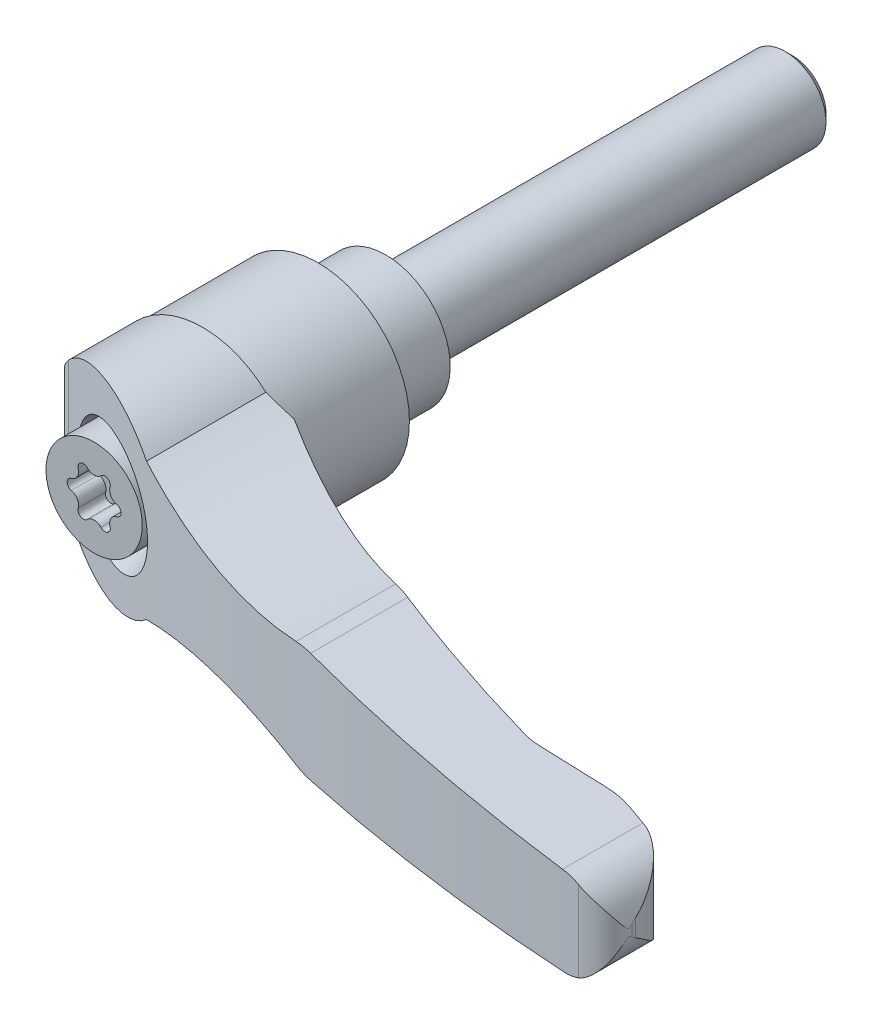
ISO-10303-21;
HEADER;
FILE_DESCRIPTION(('STEP AP214'),'2;1');
FILE_NAME('part.step','',(''),(''),'','','');
FILE_SCHEMA(('AUTOMOTIVE_DESIGN { 1 0 10303 214 1 1 1 1 }'));
ENDSEC;
DATA;
#1=APPLICATION_CONTEXT('core data for automotive mechanical design processes');
#2=APPLICATION_PROTOCOL_DEFINITION('international standard','automotive_design',2000,#1);
#3=PRODUCT_CONTEXT('',#1,'mechanical');
#4=PRODUCT('Part','Part','',(#3));
#5=PRODUCT_RELATED_PRODUCT_CATEGORY('part','',(#4));
#6=PRODUCT_DEFINITION_FORMATION('','',#4);
#7=PRODUCT_DEFINITION_CONTEXT('part definition',#1,'design');
#8=PRODUCT_DEFINITION('design','',#6,#7);
#9=PRODUCT_DEFINITION_SHAPE('','',#8);
#10=(LENGTH_UNIT() NAMED_UNIT(*) SI_UNIT(.MILLI.,.METRE.));
#11=(NAMED_UNIT(*) PLANE_ANGLE_UNIT() SI_UNIT($,.RADIAN.));
#12=(NAMED_UNIT(*) SI_UNIT($,.STERADIAN.) SOLID_ANGLE_UNIT());
#13=UNCERTAINTY_MEASURE_WITH_UNIT(LENGTH_MEASURE(1.E-05),#10,'distance_accuracy_value','');
#14=(GEOMETRIC_REPRESENTATION_CONTEXT(3) GLOBAL_UNCERTAINTY_ASSIGNED_CONTEXT((#13)) GLOBAL_UNIT_ASSIGNED_CONTEXT((#10,
#11,#12)) REPRESENTATION_CONTEXT('',''));
#15=CARTESIAN_POINT('',(0.,0.,0.));
#16=DIRECTION('',(0.,0.,1.));
#17=DIRECTION('',(1.,0.,0.));
#18=AXIS2_PLACEMENT_3D('',#15,#16,#17);
#19=CARTESIAN_POINT('',(0.,0.,-11.962456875));
#20=DIRECTION('',(0.,0.,-1.));
#21=DIRECTION('',(0.,1.,0.));
#22=AXIS2_PLACEMENT_3D('',#19,#20,#21);
#23=CYLINDRICAL_SURFACE('',#22,6.);
#24=CARTESIAN_POINT('',(0.,0.,-58.92));
#25=DIRECTION('',(0.,0.,-1.));
#26=DIRECTION('',(0.,1.,0.));
#27=AXIS2_PLACEMENT_3D('',#24,#25,#26);
#28=CIRCLE('',#27,6.);
#29=CARTESIAN_POINT('',(0.,6.,-58.92));
#30=VERTEX_POINT('',#29);
#31=EDGE_CURVE('E9',#30,#30,#28,.F.);
#32=ORIENTED_EDGE('',*,*,#31,.T.);
#33=EDGE_LOOP('',(#32));
#34=FACE_BOUND('',#33,.T.);
#35=CARTESIAN_POINT('',(0.,0.,0.));
#36=DIRECTION('',(0.,0.,-1.));
#37=DIRECTION('',(0.,1.,0.));
#38=AXIS2_PLACEMENT_3D('',#35,#36,#37);
#39=CIRCLE('',#38,6.);
#40=CARTESIAN_POINT('',(0.,6.,0.));
#41=VERTEX_POINT('',#40);
#42=EDGE_CURVE('E243',#41,#41,#39,.F.);
#43=ORIENTED_EDGE('',*,*,#42,.F.);
#44=EDGE_LOOP('',(#43));
#45=FACE_BOUND('',#44,.T.);
#46=ADVANCED_FACE('F14',(#34,#45),#23,.T.);
#47=CARTESIAN_POINT('',(7.75,0.,0.));
#48=DIRECTION('',(0.,0.,-1.));
#49=DIRECTION('',(0.,1.,0.));
#50=AXIS2_PLACEMENT_3D('',#47,#48,#49);
#51=PLANE('',#50);
#52=ORIENTED_EDGE('',*,*,#42,.T.);
#53=EDGE_LOOP('',(#52));
#54=FACE_BOUND('',#53,.T.);
#55=CARTESIAN_POINT('',(0.,0.,0.));
#56=DIRECTION('',(0.,0.,-1.));
#57=DIRECTION('',(0.,1.,0.));
#58=AXIS2_PLACEMENT_3D('',#55,#56,#57);
#59=CIRCLE('',#58,9.5);
#60=CARTESIAN_POINT('',(0.,9.5,0.));
#61=VERTEX_POINT('',#60);
#62=EDGE_CURVE('E784',#61,#61,#59,.F.);
#63=ORIENTED_EDGE('',*,*,#62,.F.);
#64=EDGE_LOOP('',(#63));
#65=FACE_BOUND('',#64,.T.);
#66=ADVANCED_FACE('F822',(#54,#65),#51,.T.);
#67=CARTESIAN_POINT('',(0.,0.,12.4));
#68=DIRECTION('',(0.,0.,-1.));
#69=DIRECTION('',(0.,1.,0.));
#70=AXIS2_PLACEMENT_3D('',#67,#68,#69);
#71=CYLINDRICAL_SURFACE('',#70,9.5);
#72=ORIENTED_EDGE('',*,*,#62,.T.);
#73=EDGE_LOOP('',(#72));
#74=FACE_BOUND('',#73,.T.);
#75=CARTESIAN_POINT('',(0.,0.,10.7));
#76=DIRECTION('',(0.,0.,-1.));
#77=DIRECTION('',(1.,0.,0.));
#78=AXIS2_PLACEMENT_3D('',#75,#76,#77);
#79=CIRCLE('',#78,9.5);
#80=CARTESIAN_POINT('',(9.5,0.,10.7));
#81=VERTEX_POINT('',#80);
#82=EDGE_CURVE('E326',#81,#81,#79,.T.);
#83=ORIENTED_EDGE('',*,*,#82,.T.);
#84=EDGE_LOOP('',(#83));
#85=FACE_BOUND('',#84,.T.);
#86=ADVANCED_FACE('F584',(#74,#85),#71,.T.);
#87=CARTESIAN_POINT('',(0.,0.,10.4));
#88=DIRECTION('',(0.,0.,-1.));
#89=DIRECTION('',(0.,1.,0.));
#90=AXIS2_PLACEMENT_3D('',#87,#88,#89);
#91=CONICAL_SURFACE('',#90,9.8,0.785398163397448);
#92=ORIENTED_EDGE('',*,*,#82,.F.);
#93=EDGE_LOOP('',(#92));
#94=FACE_BOUND('',#93,.T.);
#95=CARTESIAN_POINT('',(0.,0.,10.4));
#96=DIRECTION('',(0.,0.,-1.));
#97=DIRECTION('',(0.,1.,0.));
#98=AXIS2_PLACEMENT_3D('',#95,#96,#97);
#99=CIRCLE('',#98,9.8);
#100=CARTESIAN_POINT('',(0.,9.8,10.4));
#101=VERTEX_POINT('',#100);
#102=EDGE_CURVE('E322',#101,#101,#99,.T.);
#103=ORIENTED_EDGE('',*,*,#102,.T.);
#104=EDGE_LOOP('',(#103));
#105=FACE_BOUND('',#104,.T.);
#106=ADVANCED_FACE('F585',(#94,#105),#91,.F.);
#107=CARTESIAN_POINT('',(0.,0.,9.7));
#108=DIRECTION('',(0.,0.,-1.));
#109=DIRECTION('',(0.,1.,0.));
#110=AXIS2_PLACEMENT_3D('',#107,#108,#109);
#111=CYLINDRICAL_SURFACE('',#110,9.8);
#112=ORIENTED_EDGE('',*,*,#102,.F.);
#113=EDGE_LOOP('',(#112));
#114=FACE_BOUND('',#113,.T.);
#115=CARTESIAN_POINT('',(0.,0.,10.));
#116=DIRECTION('',(0.,0.,-1.));
#117=DIRECTION('',(0.,1.,0.));
#118=AXIS2_PLACEMENT_3D('',#115,#116,#117);
#119=CIRCLE('',#118,9.8);
#120=CARTESIAN_POINT('',(0.,9.8,10.));
#121=VERTEX_POINT('',#120);
#122=EDGE_CURVE('E325',#121,#121,#119,.F.);
#123=ORIENTED_EDGE('',*,*,#122,.F.);
#124=EDGE_LOOP('',(#123));
#125=FACE_BOUND('',#124,.T.);
#126=ADVANCED_FACE('F588',(#114,#125),#111,.F.);
#127=CARTESIAN_POINT('',(-13.2600377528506,-27.5,10.));
#128=DIRECTION('',(0.707106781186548,0.,0.707106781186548));
#129=DIRECTION('',(-0.707106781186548,0.,0.707106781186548));
#130=AXIS2_PLACEMENT_3D('',#127,#128,#129);
#131=PLANE('',#130);
#132=DIRECTION('',(0.,1.,0.));
#133=VECTOR('',#132,1.);
#134=CARTESIAN_POINT('',(-13.2600377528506,0.,10.));
#135=LINE('',#134,#133);
#136=CARTESIAN_POINT('',(-13.2600377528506,-2.58582666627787,10.));
#137=VERTEX_POINT('',#136);
#138=CARTESIAN_POINT('',(-13.2600377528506,2.58582666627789,10.));
#139=VERTEX_POINT('',#138);
#140=EDGE_CURVE('E770',#137,#139,#135,.T.);
#141=ORIENTED_EDGE('',*,*,#140,.F.);
#142=CARTESIAN_POINT('',(-0.00999999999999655,0.,-3.25003775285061));
#143=DIRECTION('',(0.707106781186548,0.,0.707106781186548));
#144=DIRECTION('',(-0.707106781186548,0.,0.707106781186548));
#145=AXIS2_PLACEMENT_3D('',#142,#143,#144);
#146=ELLIPSE('',#145,19.0918830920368,13.5);
#147=EDGE_CURVE('E772',#139,#137,#146,.T.);
#148=ORIENTED_EDGE('',*,*,#147,.F.);
#149=EDGE_LOOP('',(#141,#148));
#150=FACE_BOUND('',#149,.T.);
#151=ADVANCED_FACE('F592',(#150),#131,.F.);
#152=CARTESIAN_POINT('',(-6.76,0.,10.));
#153=DIRECTION('',(0.,0.,-1.));
#154=DIRECTION('',(0.,1.,0.));
#155=AXIS2_PLACEMENT_3D('',#152,#153,#154);
#156=PLANE('',#155);
#157=ORIENTED_EDGE('',*,*,#140,.T.);
#158=CARTESIAN_POINT('',(-0.00999999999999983,0.,10.));
#159=DIRECTION('',(0.,0.,1.));
#160=DIRECTION('',(-1.,0.,0.));
#161=AXIS2_PLACEMENT_3D('',#158,#159,#160);
#162=CIRCLE('',#161,13.5);
#163=EDGE_CURVE('E775',#137,#139,#162,.T.);
#164=ORIENTED_EDGE('',*,*,#163,.F.);
#165=EDGE_LOOP('',(#157,#164));
#166=FACE_BOUND('',#165,.T.);
#167=ORIENTED_EDGE('',*,*,#122,.T.);
#168=EDGE_LOOP('',(#167));
#169=FACE_BOUND('',#168,.T.);
#170=ADVANCED_FACE('F596',(#166,#169),#156,.T.);
#171=CARTESIAN_POINT('',(-0.0100000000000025,0.,20.75));
#172=DIRECTION('',(0.,0.,1.));
#173=DIRECTION('',(-1.,0.,0.));
#174=AXIS2_PLACEMENT_3D('',#171,#172,#173);
#175=CYLINDRICAL_SURFACE('',#174,13.5);
#176=ORIENTED_EDGE('',*,*,#163,.T.);
#177=ORIENTED_EDGE('',*,*,#147,.T.);
#178=EDGE_LOOP('',(#176,#177));
#179=FACE_BOUND('',#178,.T.);
#180=CARTESIAN_POINT('',(-0.010000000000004,0.,27.));
#181=DIRECTION('',(0.,0.,1.));
#182=DIRECTION('',(-1.,0.,0.));
#183=AXIS2_PLACEMENT_3D('',#180,#181,#182);
#184=CIRCLE('',#183,13.5);
#185=CARTESIAN_POINT('',(-13.51,0.,27.));
#186=VERTEX_POINT('',#185);
#187=CARTESIAN_POINT('',(13.4899999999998,0.,27.));
#188=VERTEX_POINT('',#187);
#189=EDGE_CURVE('E311',#186,#188,#184,.T.);
#190=ORIENTED_EDGE('',*,*,#189,.F.);
#191=CARTESIAN_POINT('',(-0.010000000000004,0.,27.));
#192=DIRECTION('',(0.,0.,1.));
#193=DIRECTION('',(-1.,0.,0.));
#194=AXIS2_PLACEMENT_3D('',#191,#192,#193);
#195=CIRCLE('',#194,13.5);
#196=EDGE_CURVE('E316',#188,#186,#195,.T.);
#197=ORIENTED_EDGE('',*,*,#196,.F.);
#198=EDGE_LOOP('',(#190,#197));
#199=FACE_BOUND('',#198,.T.);
#200=ADVANCED_FACE('F600',(#179,#199),#175,.T.);
#201=CARTESIAN_POINT('',(94.8688366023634,-14.75,58.0130023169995));
#202=DIRECTION('',(0.992331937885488,0.,-0.123601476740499));
#203=DIRECTION('',(0.123601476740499,0.,0.992331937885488));
#204=AXIS2_PLACEMENT_3D('',#201,#202,#203);
#205=PLANE('',#204);
#206=CARTESIAN_POINT('',(88.5,0.,6.88092740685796));
#207=DIRECTION('',(0.992331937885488,0.,-0.123601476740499));
#208=DIRECTION('',(0.123601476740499,0.,0.992331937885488));
#209=AXIS2_PLACEMENT_3D('',#206,#207,#208);
#210=ELLIPSE('',#209,52.588368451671,6.5);
#211=CARTESIAN_POINT('',(94.9511621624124,-0.795302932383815,58.6739513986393));
#212=VERTEX_POINT('',#211);
#213=CARTESIAN_POINT('',(94.8688366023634,-1.29919988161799,58.0130023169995));
#214=VERTEX_POINT('',#213);
#215=EDGE_CURVE('E768',#212,#214,#210,.T.);
#216=ORIENTED_EDGE('',*,*,#215,.T.);
#217=DIRECTION('',(0.,-1.,0.));
#218=VECTOR('',#217,1.);
#219=CARTESIAN_POINT('',(94.8688366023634,-14.75,58.0130023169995));
#220=LINE('',#219,#218);
#221=CARTESIAN_POINT('',(94.8688366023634,1.29919988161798,58.0130023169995));
#222=VERTEX_POINT('',#221);
#223=EDGE_CURVE('E303',#222,#214,#220,.T.);
#224=ORIENTED_EDGE('',*,*,#223,.F.);
#225=CARTESIAN_POINT('',(88.5,0.,6.88092740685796));
#226=DIRECTION('',(0.992331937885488,0.,-0.123601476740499));
#227=DIRECTION('',(0.123601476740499,0.,0.992331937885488));
#228=AXIS2_PLACEMENT_3D('',#225,#226,#227);
#229=ELLIPSE('',#228,52.588368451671,6.5);
#230=CARTESIAN_POINT('',(94.9511621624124,0.795302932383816,58.6739513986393));
#231=VERTEX_POINT('',#230);
#232=EDGE_CURVE('E769',#222,#231,#229,.T.);
#233=ORIENTED_EDGE('',*,*,#232,.T.);
#234=DIRECTION('',(0.,-1.,0.));
#235=VECTOR('',#234,1.);
#236=CARTESIAN_POINT('',(94.9511621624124,-14.75,58.6739513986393));
#237=LINE('',#236,#235);
#238=EDGE_CURVE('E765',#231,#212,#237,.T.);
#239=ORIENTED_EDGE('',*,*,#238,.T.);
#240=EDGE_LOOP('',(#216,#224,#233,#239));
#241=FACE_BOUND('',#240,.T.);
#242=ADVANCED_FACE('F604',(#241),#205,.T.);
#243=CARTESIAN_POINT('',(-13.51,-14.75,27.));
#244=DIRECTION('',(0.,0.,-1.));
#245=DIRECTION('',(0.,1.,0.));
#246=AXIS2_PLACEMENT_3D('',#243,#244,#245);
#247=PLANE('',#246);
#248=DIRECTION('',(0.,-1.,0.));
#249=VECTOR('',#248,1.);
#250=CARTESIAN_POINT('',(-13.51,-14.75,27.));
#251=LINE('',#250,#249);
#252=CARTESIAN_POINT('',(-13.51,2.55781156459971,27.));
#253=VERTEX_POINT('',#252);
#254=EDGE_CURVE('E312',#253,#186,#251,.T.);
#255=ORIENTED_EDGE('',*,*,#254,.F.);
#256=CARTESIAN_POINT('',(0.,0.,27.));
#257=DIRECTION('',(0.,0.,1.));
#258=DIRECTION('',(0.,-1.,0.));
#259=AXIS2_PLACEMENT_3D('',#256,#257,#258);
#260=CIRCLE('',#259,13.75);
#261=CARTESIAN_POINT('',(9.32365402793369,10.1060365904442,27.));
#262=VERTEX_POINT('',#261);
#263=EDGE_CURVE('E488',#262,#253,#260,.T.);
#264=ORIENTED_EDGE('',*,*,#263,.F.);
#265=CARTESIAN_POINT('',(29.15,64.91,27.));
#266=DIRECTION('',(0.,0.,1.));
#267=DIRECTION('',(0.,-1.,0.));
#268=AXIS2_PLACEMENT_3D('',#265,#266,#267);
#269=CIRCLE('',#268,58.28);
#270=CARTESIAN_POINT('',(13.4899999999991,8.77335599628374,27.));
#271=VERTEX_POINT('',#270);
#272=EDGE_CURVE('E450',#262,#271,#269,.T.);
#273=ORIENTED_EDGE('',*,*,#272,.T.);
#274=DIRECTION('',(0.,-1.,0.));
#275=VECTOR('',#274,1.);
#276=CARTESIAN_POINT('',(13.4899999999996,-14.75,27.0000000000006));
#277=LINE('',#276,#275);
#278=EDGE_CURVE('E307',#271,#188,#277,.T.);
#279=ORIENTED_EDGE('',*,*,#278,.T.);
#280=ORIENTED_EDGE('',*,*,#196,.T.);
#281=EDGE_LOOP('',(#255,#264,#273,#279,#280));
#282=FACE_BOUND('',#281,.T.);
#283=ADVANCED_FACE('F608',(#282),#247,.T.);
#284=CARTESIAN_POINT('',(-13.51,-14.75,31.4135672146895));
#285=DIRECTION('',(-1.,0.,0.));
#286=DIRECTION('',(0.,-1.,0.));
#287=AXIS2_PLACEMENT_3D('',#284,#285,#286);
#288=PLANE('',#287);
#289=DIRECTION('',(0.,0.,1.));
#290=VECTOR('',#289,1.);
#291=CARTESIAN_POINT('',(-13.51,-2.5578115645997,63.));
#292=LINE('',#291,#290);
#293=CARTESIAN_POINT('',(-13.51,-2.55781156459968,31.4135672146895));
#294=VERTEX_POINT('',#293);
#295=CARTESIAN_POINT('',(-13.51,-2.55781156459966,27.));
#296=VERTEX_POINT('',#295);
#297=EDGE_CURVE('E315',#294,#296,#292,.F.);
#298=ORIENTED_EDGE('',*,*,#297,.F.);
#299=DIRECTION('',(0.,-1.,0.));
#300=VECTOR('',#299,1.);
#301=CARTESIAN_POINT('',(-13.51,-14.75,31.4135672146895));
#302=LINE('',#301,#300);
#303=CARTESIAN_POINT('',(-13.51,2.55781156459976,31.4135672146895));
#304=VERTEX_POINT('',#303);
#305=EDGE_CURVE('E502',#304,#294,#302,.T.);
#306=ORIENTED_EDGE('',*,*,#305,.F.);
#307=DIRECTION('',(0.,0.,1.));
#308=VECTOR('',#307,1.);
#309=CARTESIAN_POINT('',(-13.51,2.55781156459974,63.));
#310=LINE('',#309,#308);
#311=EDGE_CURVE('E491',#253,#304,#310,.T.);
#312=ORIENTED_EDGE('',*,*,#311,.F.);
#313=ORIENTED_EDGE('',*,*,#254,.T.);
#314=DIRECTION('',(0.,1.,0.));
#315=VECTOR('',#314,1.);
#316=CARTESIAN_POINT('',(-13.51,-14.75,27.));
#317=LINE('',#316,#315);
#318=EDGE_CURVE('E750',#296,#186,#317,.T.);
#319=ORIENTED_EDGE('',*,*,#318,.F.);
#320=EDGE_LOOP('',(#298,#306,#312,#313,#319));
#321=FACE_BOUND('',#320,.T.);
#322=ADVANCED_FACE('F612',(#321),#288,.T.);
#323=CARTESIAN_POINT('',(-13.51,-14.75,27.));
#324=DIRECTION('',(0.,0.,-1.));
#325=DIRECTION('',(0.,1.,0.));
#326=AXIS2_PLACEMENT_3D('',#323,#324,#325);
#327=PLANE('',#326);
#328=ORIENTED_EDGE('',*,*,#189,.T.);
#329=DIRECTION('',(0.,-1.,0.));
#330=VECTOR('',#329,1.);
#331=CARTESIAN_POINT('',(13.4899999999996,-14.75,27.0000000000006));
#332=LINE('',#331,#330);
#333=CARTESIAN_POINT('',(13.4899999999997,-8.77335599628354,27.));
#334=VERTEX_POINT('',#333);
#335=EDGE_CURVE('E741',#188,#334,#332,.T.);
#336=ORIENTED_EDGE('',*,*,#335,.T.);
#337=CARTESIAN_POINT('',(29.15,-64.91,27.));
#338=DIRECTION('',(0.,0.,1.));
#339=DIRECTION('',(0.,-1.,0.));
#340=AXIS2_PLACEMENT_3D('',#337,#338,#339);
#341=CIRCLE('',#340,58.28);
#342=CARTESIAN_POINT('',(9.32365402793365,-10.1060365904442,27.));
#343=VERTEX_POINT('',#342);
#344=EDGE_CURVE('E737',#334,#343,#341,.T.);
#345=ORIENTED_EDGE('',*,*,#344,.T.);
#346=CARTESIAN_POINT('',(0.,0.,27.));
#347=DIRECTION('',(0.,0.,1.));
#348=DIRECTION('',(0.,-1.,0.));
#349=AXIS2_PLACEMENT_3D('',#346,#347,#348);
#350=CIRCLE('',#349,13.75);
#351=EDGE_CURVE('E736',#296,#343,#350,.T.);
#352=ORIENTED_EDGE('',*,*,#351,.F.);
#353=ORIENTED_EDGE('',*,*,#318,.T.);
#354=EDGE_LOOP('',(#328,#336,#345,#352,#353));
#355=FACE_BOUND('',#354,.T.);
#356=ADVANCED_FACE('F616',(#355),#327,.T.);
#357=CARTESIAN_POINT('',(81.4673032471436,-14.75,62.36));
#358=DIRECTION('',(0.,-1.,0.));
#359=DIRECTION('',(1.,0.,0.));
#360=AXIS2_PLACEMENT_3D('',#357,#358,#359);
#361=CYLINDRICAL_SURFACE('',#360,13.39);
#362=CARTESIAN_POINT('',(81.4673032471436,-6.75541913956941,62.36));
#363=DIRECTION('',(-0.0362948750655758,0.999341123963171,0.));
#364=DIRECTION('',(-0.999341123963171,-0.0362948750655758,0.));
#365=AXIS2_PLACEMENT_3D('',#362,#363,#364);
#366=ELLIPSE('',#365,13.3988281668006,13.39);
#367=CARTESIAN_POINT('',(85.7182287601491,-6.60103060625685,49.6626879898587));
#368=VERTEX_POINT('',#367);
#369=CARTESIAN_POINT('',(81.4673032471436,-6.75541913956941,48.97));
#370=VERTEX_POINT('',#369);
#371=EDGE_CURVE('E640',#368,#370,#366,.T.);
#372=ORIENTED_EDGE('',*,*,#371,.T.);
#373=DIRECTION('',(0.,1.,0.));
#374=VECTOR('',#373,1.);
#375=CARTESIAN_POINT('',(81.4673032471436,-14.75,48.97));
#376=LINE('',#375,#374);
#377=CARTESIAN_POINT('',(81.4673032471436,6.75541913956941,48.97));
#378=VERTEX_POINT('',#377);
#379=EDGE_CURVE('E308',#378,#370,#376,.F.);
#380=ORIENTED_EDGE('',*,*,#379,.F.);
#381=CARTESIAN_POINT('',(81.4673032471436,6.75541913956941,62.36));
#382=DIRECTION('',(-0.0362948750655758,-0.999341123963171,0.));
#383=DIRECTION('',(0.999341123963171,-0.0362948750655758,0.));
#384=AXIS2_PLACEMENT_3D('',#381,#382,#383);
#385=ELLIPSE('',#384,13.3988281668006,13.39);
#386=CARTESIAN_POINT('',(85.7182287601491,6.60103060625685,49.6626879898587));
#387=VERTEX_POINT('',#386);
#388=EDGE_CURVE('E452',#378,#387,#385,.T.);
#389=ORIENTED_EDGE('',*,*,#388,.T.);
#390=DIRECTION('',(0.,-1.,0.));
#391=VECTOR('',#390,1.);
#392=CARTESIAN_POINT('',(85.7182287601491,-14.75,49.6626879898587));
#393=LINE('',#392,#391);
#394=EDGE_CURVE('E300',#368,#387,#393,.F.);
#395=ORIENTED_EDGE('',*,*,#394,.F.);
#396=EDGE_LOOP('',(#372,#380,#389,#395));
#397=FACE_BOUND('',#396,.T.);
#398=ADVANCED_FACE('F620',(#397),#361,.T.);
#399=CARTESIAN_POINT('',(71.6523269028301,-14.75,48.97));
#400=DIRECTION('',(0.,0.,-1.));
#401=DIRECTION('',(0.,1.,0.));
#402=AXIS2_PLACEMENT_3D('',#399,#400,#401);
#403=PLANE('',#402);
#404=DIRECTION('',(-0.999341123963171,-0.0362948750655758,0.));
#405=VECTOR('',#404,1.);
#406=CARTESIAN_POINT('',(88.5,-6.5,48.97));
#407=LINE('',#406,#405);
#408=CARTESIAN_POINT('',(71.6523269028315,-7.11188734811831,48.97));
#409=VERTEX_POINT('',#408);
#410=EDGE_CURVE('E632',#370,#409,#407,.T.);
#411=ORIENTED_EDGE('',*,*,#410,.T.);
#412=DIRECTION('',(0.,-1.,0.));
#413=VECTOR('',#412,1.);
#414=CARTESIAN_POINT('',(71.6523269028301,-14.75,48.97));
#415=LINE('',#414,#413);
#416=CARTESIAN_POINT('',(71.6523269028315,7.11188734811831,48.97));
#417=VERTEX_POINT('',#416);
#418=EDGE_CURVE('E305',#409,#417,#415,.F.);
#419=ORIENTED_EDGE('',*,*,#418,.T.);
#420=DIRECTION('',(0.999341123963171,-0.0362948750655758,0.));
#421=VECTOR('',#420,1.);
#422=CARTESIAN_POINT('',(43.9670619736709,8.1173830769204,48.97));
#423=LINE('',#422,#421);
#424=EDGE_CURVE('E760',#417,#378,#423,.T.);
#425=ORIENTED_EDGE('',*,*,#424,.T.);
#426=ORIENTED_EDGE('',*,*,#379,.T.);
#427=EDGE_LOOP('',(#411,#419,#425,#426));
#428=FACE_BOUND('',#427,.T.);
#429=ADVANCED_FACE('F623',(#428),#403,.T.);
#430=CARTESIAN_POINT('',(71.6523269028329,-14.75,38.8899999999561));
#431=DIRECTION('',(0.,-1.,0.));
#432=DIRECTION('',(1.,0.,0.));
#433=AXIS2_PLACEMENT_3D('',#430,#431,#432);
#434=CYLINDRICAL_SURFACE('',#433,10.0800000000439);
#435=ORIENTED_EDGE('',*,*,#418,.F.);
#436=CARTESIAN_POINT('',(71.6523269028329,-7.11188734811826,38.8899999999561));
#437=DIRECTION('',(-0.0362948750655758,0.999341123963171,0.));
#438=DIRECTION('',(-0.999341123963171,-0.0362948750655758,0.));
#439=AXIS2_PLACEMENT_3D('',#436,#437,#438);
#440=ELLIPSE('',#439,10.086645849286,10.0800000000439);
#441=CARTESIAN_POINT('',(69.1344137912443,-7.20333494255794,48.6504566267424));
#442=VERTEX_POINT('',#441);
#443=EDGE_CURVE('E639',#409,#442,#440,.F.);
#444=ORIENTED_EDGE('',*,*,#443,.T.);
#445=DIRECTION('',(0.,-1.,0.));
#446=VECTOR('',#445,1.);
#447=CARTESIAN_POINT('',(69.1344156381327,-14.75,48.6504571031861));
#448=LINE('',#447,#446);
#449=CARTESIAN_POINT('',(69.1344137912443,7.20333494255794,48.6504566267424));
#450=VERTEX_POINT('',#449);
#451=EDGE_CURVE('E744',#442,#450,#448,.F.);
#452=ORIENTED_EDGE('',*,*,#451,.T.);
#453=CARTESIAN_POINT('',(71.6523269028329,7.11188734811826,38.8899999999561));
#454=DIRECTION('',(-0.0362948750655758,-0.999341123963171,0.));
#455=DIRECTION('',(0.999341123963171,-0.0362948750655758,0.));
#456=AXIS2_PLACEMENT_3D('',#453,#454,#455);
#457=ELLIPSE('',#456,10.086645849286,10.0800000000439);
#458=EDGE_CURVE('E643',#450,#417,#457,.F.);
#459=ORIENTED_EDGE('',*,*,#458,.T.);
#460=EDGE_LOOP('',(#435,#444,#452,#459));
#461=FACE_BOUND('',#460,.T.);
#462=ADVANCED_FACE('F460',(#461),#434,.F.);
#463=CARTESIAN_POINT('',(132.162219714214,-14.75,-195.670803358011));
#464=DIRECTION('',(0.,-1.,0.));
#465=DIRECTION('',(1.,0.,0.));
#466=AXIS2_PLACEMENT_3D('',#463,#464,#465);
#467=CYLINDRICAL_SURFACE('',#466,252.32);
#468=CARTESIAN_POINT('',(43.9670619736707,8.11738307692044,40.7335040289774));
#469=CARTESIAN_POINT('',(43.7285909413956,8.12604852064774,40.6445396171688));
#470=CARTESIAN_POINT('',(43.4900264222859,8.12742192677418,40.5551257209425));
#471=CARTESIAN_POINT('',(43.014251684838,8.11567103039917,40.375985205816));
#472=CARTESIAN_POINT('',(42.7770395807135,8.10259351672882,40.2862605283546));
#473=CARTESIAN_POINT('',(42.3039618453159,8.06208212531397,40.1065066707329));
#474=CARTESIAN_POINT('',(42.0680962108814,8.03464828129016,40.0164774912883));
#475=CARTESIAN_POINT('',(41.5977019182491,7.96541677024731,39.8361272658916));
#476=CARTESIAN_POINT('',(41.3631800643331,7.92357286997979,39.7458062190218));
#477=CARTESIAN_POINT('',(41.1300932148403,7.87460952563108,39.6556387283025));
#478=B_SPLINE_CURVE_WITH_KNOTS('',3,(#468,#469,#470,#471,#472,#473,#474,#475,#476,#477),
.UNSPECIFIED.,.F.,.F.,(4,2,2,2,4),(0.,0.763908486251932,1.52535083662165,2.28679139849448,
3.05069808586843),.UNSPECIFIED.);
#479=CARTESIAN_POINT('',(43.9670619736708,8.11738307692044,40.7335040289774));
#480=VERTEX_POINT('',#479);
#481=CARTESIAN_POINT('',(41.1300932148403,7.87460952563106,39.6556387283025));
#482=VERTEX_POINT('',#481);
#483=EDGE_CURVE('E440',#480,#482,#478,.T.);
#484=ORIENTED_EDGE('',*,*,#483,.F.);
#485=CARTESIAN_POINT('',(132.162219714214,4.9142403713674,-195.670803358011));
#486=DIRECTION('',(-0.0362948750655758,-0.999341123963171,0.));
#487=DIRECTION('',(0.999341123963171,-0.0362948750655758,0.));
#488=AXIS2_PLACEMENT_3D('',#485,#486,#487);
#489=ELLIPSE('',#488,252.486357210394,252.32);
#490=EDGE_CURVE('E715',#480,#450,#489,.F.);
#491=ORIENTED_EDGE('',*,*,#490,.T.);
#492=ORIENTED_EDGE('',*,*,#451,.F.);
#493=CARTESIAN_POINT('',(132.162219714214,-4.91424037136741,-195.670803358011));
#494=DIRECTION('',(-0.0362948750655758,0.999341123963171,0.));
#495=DIRECTION('',(-0.999341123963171,-0.0362948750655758,0.));
#496=AXIS2_PLACEMENT_3D('',#493,#494,#495);
#497=ELLIPSE('',#496,252.486357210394,252.32);
#498=CARTESIAN_POINT('',(43.9670619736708,-8.11738307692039,40.7335040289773));
#499=VERTEX_POINT('',#498);
#500=EDGE_CURVE('E647',#442,#499,#497,.F.);
#501=ORIENTED_EDGE('',*,*,#500,.T.);
#502=CARTESIAN_POINT('',(41.1300929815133,-7.87460947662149,39.6556386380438));
#503=CARTESIAN_POINT('',(41.3631798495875,-7.92357282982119,39.7458061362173));
#504=CARTESIAN_POINT('',(41.5977017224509,-7.96541673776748,39.8361271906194));
#505=CARTESIAN_POINT('',(42.0680960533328,-8.03464826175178,40.0164774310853));
#506=CARTESIAN_POINT('',(42.3039617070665,-8.06208211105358,40.1065066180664));
#507=CARTESIAN_POINT('',(42.7770394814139,-8.10259351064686,40.2862604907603));
#508=CARTESIAN_POINT('',(43.0142516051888,-8.11567102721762,40.3759851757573));
#509=CARTESIAN_POINT('',(43.4900263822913,-8.12742192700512,40.5551257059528));
#510=CARTESIAN_POINT('',(43.7285909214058,-8.12604852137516,40.6445396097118));
#511=CARTESIAN_POINT('',(43.9670619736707,-8.11738307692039,40.7335040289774));
#512=B_SPLINE_CURVE_WITH_KNOTS('',3,(#502,#503,#504,#505,#506,#507,#508,#509,#510,#511),
.UNSPECIFIED.,.F.,.F.,(4,2,2,2,4),(0.,0.763906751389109,1.52534737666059,2.28678979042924,
3.05069834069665),.UNSPECIFIED.);
#513=CARTESIAN_POINT('',(41.1300929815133,-7.8746094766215,39.6556386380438));
#514=VERTEX_POINT('',#513);
#515=EDGE_CURVE('E475',#514,#499,#512,.T.);
#516=ORIENTED_EDGE('',*,*,#515,.F.);
#517=CARTESIAN_POINT('',(41.1300929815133,-7.87460947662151,39.6556386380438));
#518=CARTESIAN_POINT('',(40.2468666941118,-7.68907790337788,39.3139933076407));
#519=CARTESIAN_POINT('',(39.3617638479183,-7.52459842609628,38.9658739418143));
#520=CARTESIAN_POINT('',(37.5897998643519,-7.23736069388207,38.2572801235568));
#521=CARTESIAN_POINT('',(36.7029388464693,-7.11459969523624,37.8968064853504));
#522=CARTESIAN_POINT('',(34.9294341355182,-6.91040287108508,37.1640922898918));
#523=CARTESIAN_POINT('',(34.0427904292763,-6.8289625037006,36.7918530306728));
#524=CARTESIAN_POINT('',(32.2715033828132,-6.70688253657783,36.0362417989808));
#525=CARTESIAN_POINT('',(31.3868600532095,-6.66624315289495,35.652869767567));
#526=CARTESIAN_POINT('',(28.7704435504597,-6.60545291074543,34.5011035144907));
#527=CARTESIAN_POINT('',(27.0436661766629,-6.64276527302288,33.7176215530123));
#528=CARTESIAN_POINT('',(23.6170342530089,-6.86784257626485,32.1161606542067));
#529=CARTESIAN_POINT('',(21.9171693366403,-7.05554807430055,31.2981954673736));
#530=CARTESIAN_POINT('',(19.6661800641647,-7.4039275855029,30.1840812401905));
#531=CARTESIAN_POINT('',(19.0983988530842,-7.50046620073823,29.9003744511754));
#532=CARTESIAN_POINT('',(17.9675115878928,-7.70999213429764,29.3299782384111));
#533=CARTESIAN_POINT('',(17.4044045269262,-7.82297580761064,29.043289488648));
#534=CARTESIAN_POINT('',(16.2796310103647,-8.06595772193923,28.4653390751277));
#535=CARTESIAN_POINT('',(15.7179955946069,-8.19605796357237,28.1740600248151));
#536=CARTESIAN_POINT('',(14.5999573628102,-8.472545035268,27.5889003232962));
#537=CARTESIAN_POINT('',(14.0435556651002,-8.61893526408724,27.2950191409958));
#538=CARTESIAN_POINT('',(13.4899999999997,-8.77335599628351,27.0000000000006));
#539=B_SPLINE_CURVE_WITH_KNOTS('',3,(#517,#518,#519,#520,#521,#522,#523,#524,#525,#526,#527,
#528,#529,#530,#531,#532,#533,#534,#535,#536,#537,#538),.UNSPECIFIED.,.F.,.F.,(4,2,2,2,2,2,2,2,
2,2,4),(0.,2.89469970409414,5.78920899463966,8.6834000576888,11.5776064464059,17.2602540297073,
22.940656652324,24.866551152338,26.7920194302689,28.7295308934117,30.6674473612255),.UNSPECIFIED.);
#540=EDGE_CURVE('E466',#514,#334,#539,.T.);
#541=ORIENTED_EDGE('',*,*,#540,.T.);
#542=ORIENTED_EDGE('',*,*,#335,.F.);
#543=ORIENTED_EDGE('',*,*,#278,.F.);
#544=CARTESIAN_POINT('',(13.4899999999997,8.77335599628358,27.0000000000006));
#545=CARTESIAN_POINT('',(14.31664655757,8.54275177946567,27.4405727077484));
#546=CARTESIAN_POINT('',(15.149663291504,8.33005321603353,27.8786057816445));
#547=CARTESIAN_POINT('',(16.82730612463,7.94113938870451,28.7487404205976));
#548=CARTESIAN_POINT('',(17.6719330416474,7.76492670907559,29.1808415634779));
#549=CARTESIAN_POINT('',(19.3724293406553,7.44952599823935,30.0386421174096));
#550=CARTESIAN_POINT('',(20.2283094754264,7.31037656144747,30.4643344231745));
#551=CARTESIAN_POINT('',(21.9491324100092,7.07004305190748,31.3079971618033));
#552=CARTESIAN_POINT('',(22.8140749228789,6.96885778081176,31.725967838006));
#553=CARTESIAN_POINT('',(24.5350860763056,6.80669813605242,32.5454832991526));
#554=CARTESIAN_POINT('',(25.3910090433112,6.74499321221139,32.9471893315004));
#555=CARTESIAN_POINT('',(27.1088771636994,6.65940525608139,33.7416486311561));
#556=CARTESIAN_POINT('',(27.9708222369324,6.63552172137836,34.1344020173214));
#557=CARTESIAN_POINT('',(29.6986634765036,6.62618362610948,34.9099811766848));
#558=CARTESIAN_POINT('',(30.5645565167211,6.64070263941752,35.2928135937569));
#559=CARTESIAN_POINT('',(32.2992228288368,6.70867652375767,36.0481188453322));
#560=CARTESIAN_POINT('',(33.1679956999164,6.76212618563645,36.4205930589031));
#561=CARTESIAN_POINT('',(34.6268488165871,6.88489763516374,37.0364018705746));
#562=CARTESIAN_POINT('',(35.2165959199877,6.94356774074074,37.2827020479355));
#563=CARTESIAN_POINT('',(36.396064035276,7.07916681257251,37.7700518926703));
#564=CARTESIAN_POINT('',(36.9857850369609,7.15609293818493,38.0111023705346));
#565=CARTESIAN_POINT('',(38.1685846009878,7.32890006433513,38.4893735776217));
#566=CARTESIAN_POINT('',(38.7616598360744,7.42490199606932,38.7265588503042));
#567=CARTESIAN_POINT('',(39.9468049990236,7.63566195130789,39.1953420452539));
#568=CARTESIAN_POINT('',(40.5388747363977,7.75042319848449,39.4269389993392));
#569=CARTESIAN_POINT('',(41.1300932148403,7.87460952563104,39.6556387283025));
#570=B_SPLINE_CURVE_WITH_KNOTS('',3,(#544,#545,#546,#547,#548,#549,#550,#551,#552,#553,#554,
#555,#556,#557,#558,#559,#560,#561,#562,#563,#564,#565,#566,#567,#568,#569),.UNSPECIFIED.,.F.,
.F.,(4,2,2,2,2,2,2,2,2,2,2,2,4),(0.,2.89390785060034,5.78802060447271,8.68513535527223,
11.5821586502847,14.4238937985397,17.2655911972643,20.1053336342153,22.9446961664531,
24.8698413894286,26.7946872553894,28.7321491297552,30.6699442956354),.UNSPECIFIED.);
#571=EDGE_CURVE('E481',#271,#482,#570,.T.);
#572=ORIENTED_EDGE('',*,*,#571,.T.);
#573=EDGE_LOOP('',(#484,#491,#492,#501,#516,#541,#542,#543,#572));
#574=FACE_BOUND('',#573,.T.);
#575=ADVANCED_FACE('F454',(#574),#467,.F.);
#576=CARTESIAN_POINT('',(85.7182287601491,-14.75,49.6626879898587));
#577=DIRECTION('',(0.317470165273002,0.,-0.948268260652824));
#578=DIRECTION('',(0.948268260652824,0.,0.317470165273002));
#579=AXIS2_PLACEMENT_3D('',#576,#577,#578);
#580=PLANE('',#579);
#581=DIRECTION('',(-0.947706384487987,-0.0344195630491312,-0.317282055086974));
#582=VECTOR('',#581,1.);
#583=CARTESIAN_POINT('',(88.5,-6.5,50.5939955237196));
#584=LINE('',#583,#582);
#585=CARTESIAN_POINT('',(88.5,-6.5,50.5939955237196));
#586=VERTEX_POINT('',#585);
#587=EDGE_CURVE('E661',#586,#368,#584,.T.);
#588=ORIENTED_EDGE('',*,*,#587,.T.);
#589=ORIENTED_EDGE('',*,*,#394,.T.);
#590=DIRECTION('',(0.947706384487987,-0.0344195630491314,0.317282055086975));
#591=VECTOR('',#590,1.);
#592=CARTESIAN_POINT('',(85.7182287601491,6.60103060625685,49.6626879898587));
#593=LINE('',#592,#591);
#594=CARTESIAN_POINT('',(88.5,6.5,50.5939955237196));
#595=VERTEX_POINT('',#594);
#596=EDGE_CURVE('E449',#387,#595,#593,.T.);
#597=ORIENTED_EDGE('',*,*,#596,.T.);
#598=CARTESIAN_POINT('',(88.5,0.,50.5939955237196));
#599=DIRECTION('',(0.317470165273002,0.,-0.948268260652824));
#600=DIRECTION('',(0.948268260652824,0.,0.317470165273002));
#601=AXIS2_PLACEMENT_3D('',#598,#599,#600);
#602=ELLIPSE('',#601,6.8546004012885,6.5);
#603=CARTESIAN_POINT('',(88.9098071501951,6.48706852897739,50.7311946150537));
#604=VERTEX_POINT('',#603);
#605=EDGE_CURVE('E320',#604,#595,#602,.F.);
#606=ORIENTED_EDGE('',*,*,#605,.F.);
#607=DIRECTION('',(0.,-1.,0.));
#608=VECTOR('',#607,1.);
#609=CARTESIAN_POINT('',(88.9098071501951,-14.75,50.7311946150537));
#610=LINE('',#609,#608);
#611=CARTESIAN_POINT('',(88.9098071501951,-6.4870685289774,50.7311946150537));
#612=VERTEX_POINT('',#611);
#613=EDGE_CURVE('E321',#612,#604,#610,.F.);
#614=ORIENTED_EDGE('',*,*,#613,.F.);
#615=CARTESIAN_POINT('',(88.5,0.,50.5939955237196));
#616=DIRECTION('',(0.317470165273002,0.,-0.948268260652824));
#617=DIRECTION('',(0.948268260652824,0.,0.317470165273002));
#618=AXIS2_PLACEMENT_3D('',#615,#616,#617);
#619=ELLIPSE('',#618,6.8546004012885,6.5);
#620=EDGE_CURVE('E304',#612,#586,#619,.T.);
#621=ORIENTED_EDGE('',*,*,#620,.T.);
#622=EDGE_LOOP('',(#588,#589,#597,#606,#614,#621));
#623=FACE_BOUND('',#622,.T.);
#624=ADVANCED_FACE('F459',(#623),#580,.T.);
#625=CARTESIAN_POINT('',(86.1065455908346,-14.75,59.1044033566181));
#626=DIRECTION('',(0.,-1.,0.));
#627=DIRECTION('',(1.,0.,0.));
#628=AXIS2_PLACEMENT_3D('',#625,#626,#627);
#629=CYLINDRICAL_SURFACE('',#628,8.83);
#630=CARTESIAN_POINT('',(88.9098071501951,-6.4870685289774,50.7311946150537));
#631=CARTESIAN_POINT('',(89.089769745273,-6.4757277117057,50.7913988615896));
#632=CARTESIAN_POINT('',(89.2672358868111,-6.4569733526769,50.8573067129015));
#633=CARTESIAN_POINT('',(89.6156587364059,-6.40594654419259,50.9994566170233));
#634=CARTESIAN_POINT('',(89.7866254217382,-6.37369580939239,51.0756819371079));
#635=CARTESIAN_POINT('',(90.1193873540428,-6.29733777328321,51.2367553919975));
#636=CARTESIAN_POINT('',(90.2812591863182,-6.25335658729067,51.3215061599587));
#637=CARTESIAN_POINT('',(90.5970344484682,-6.15465850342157,51.4993225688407));
#638=CARTESIAN_POINT('',(90.750933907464,-6.09993631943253,51.5923922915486));
#639=CARTESIAN_POINT('',(91.0845425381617,-5.96735555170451,51.8080731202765));
#640=CARTESIAN_POINT('',(91.2620732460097,-5.88706921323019,51.9325631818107));
#641=CARTESIAN_POINT('',(91.6037719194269,-5.71430400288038,52.1909876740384));
#642=CARTESIAN_POINT('',(91.7679381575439,-5.62182355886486,52.3249233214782));
#643=CARTESIAN_POINT('',(92.0835205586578,-5.42614069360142,52.6014136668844));
#644=CARTESIAN_POINT('',(92.2348770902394,-5.32289263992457,52.7440038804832));
#645=CARTESIAN_POINT('',(92.5241674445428,-5.10769832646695,53.036019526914));
#646=CARTESIAN_POINT('',(92.6621003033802,-4.99575144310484,53.1854454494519));
#647=CARTESIAN_POINT('',(92.9757333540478,-4.71982512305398,53.5491307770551));
#648=CARTESIAN_POINT('',(93.1453696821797,-4.552486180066,53.7660853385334));
#649=CARTESIAN_POINT('',(93.4603079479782,-4.20713466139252,54.208999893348));
#650=CARTESIAN_POINT('',(93.6056001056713,-4.02911783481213,54.4349634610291));
#651=CARTESIAN_POINT('',(93.8728003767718,-3.66523875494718,54.8943200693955));
#652=CARTESIAN_POINT('',(93.9947026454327,-3.47937455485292,55.1277149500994));
#653=CARTESIAN_POINT('',(94.2159458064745,-3.10252192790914,55.600867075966));
#654=CARTESIAN_POINT('',(94.3152909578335,-2.91153447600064,55.8406231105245));
#655=CARTESIAN_POINT('',(94.4598076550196,-2.59782196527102,56.2375651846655));
#656=CARTESIAN_POINT('',(94.5115034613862,-2.47567903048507,56.3928781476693));
#657=CARTESIAN_POINT('',(94.6062509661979,-2.23176482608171,56.7063336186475));
#658=CARTESIAN_POINT('',(94.6493059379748,-2.10999343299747,56.8644750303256));
#659=CARTESIAN_POINT('',(94.7073954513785,-1.92930841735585,57.1041561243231));
#660=CARTESIAN_POINT('',(94.7256435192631,-1.86953763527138,57.1842829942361));
#661=CARTESIAN_POINT('',(94.7600223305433,-1.75098004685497,57.3456972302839));
#662=CARTESIAN_POINT('',(94.7761533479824,-1.69219311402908,57.4269844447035));
#663=CARTESIAN_POINT('',(94.8063065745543,-1.57609424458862,57.5911123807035));
#664=CARTESIAN_POINT('',(94.8203269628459,-1.51878361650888,57.6739543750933));
#665=CARTESIAN_POINT('',(94.8462112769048,-1.4067606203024,57.8417526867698));
#666=CARTESIAN_POINT('',(94.8580742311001,-1.35204943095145,57.9267099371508));
#667=CARTESIAN_POINT('',(94.8688366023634,-1.29919988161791,58.0130023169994));
#668=B_SPLINE_CURVE_WITH_KNOTS('',3,(#630,#631,#632,#633,#634,#635,#636,#637,#638,#639,#640,
#641,#642,#643,#644,#645,#646,#647,#648,#649,#650,#651,#652,#653,#654,#655,#656,#657,#658,#659,
#660,#661,#662,#663,#664,#665,#666,#667),.UNSPECIFIED.,.F.,.F.,(4,2,2,2,2,2,2,2,2,2,2,2,2,2,2,2,
2,2,4),(0.,0.569903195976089,1.1388929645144,1.70199618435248,2.26537722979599,2.95800230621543,
3.6507167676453,4.3464963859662,5.04232592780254,6.00766077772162,6.97338251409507,
7.9393452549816,8.90512546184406,9.51766996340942,10.129981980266,10.4348045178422,
10.7395875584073,11.0446320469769,11.3498135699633),.UNSPECIFIED.);
#669=EDGE_CURVE('E362',#612,#214,#668,.T.);
#670=ORIENTED_EDGE('',*,*,#669,.F.);
#671=ORIENTED_EDGE('',*,*,#613,.T.);
#672=CARTESIAN_POINT('',(94.8688366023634,1.29919988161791,58.0130023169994));
#673=CARTESIAN_POINT('',(94.8598905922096,1.34309764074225,57.9412335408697));
#674=CARTESIAN_POINT('',(94.8501811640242,1.38833454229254,57.8704151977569));
#675=CARTESIAN_POINT('',(94.8292644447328,1.48075225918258,57.7303150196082));
#676=CARTESIAN_POINT('',(94.8180576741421,1.52793239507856,57.6610326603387));
#677=CARTESIAN_POINT('',(94.7822406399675,1.67127035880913,57.454961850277));
#678=CARTESIAN_POINT('',(94.7554216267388,1.76928633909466,57.3198547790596));
#679=CARTESIAN_POINT('',(94.6959351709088,1.96751896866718,57.0525736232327));
#680=CARTESIAN_POINT('',(94.6632668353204,2.06773595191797,56.9203999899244));
#681=CARTESIAN_POINT('',(94.5920450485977,2.26900598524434,56.6582540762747));
#682=CARTESIAN_POINT('',(94.5534905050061,2.37005918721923,56.5282822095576));
#683=CARTESIAN_POINT('',(94.4700311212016,2.57311073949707,56.2689600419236));
#684=CARTESIAN_POINT('',(94.4250680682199,2.67510870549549,56.1396281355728));
#685=CARTESIAN_POINT('',(94.3289987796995,2.87844084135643,55.8827641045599));
#686=CARTESIAN_POINT('',(94.2778928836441,2.97977504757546,55.7552318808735));
#687=CARTESIAN_POINT('',(94.1152135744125,3.28202886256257,55.3753189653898));
#688=CARTESIAN_POINT('',(93.9942476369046,3.48127599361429,55.1255256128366));
#689=CARTESIAN_POINT('',(93.7497347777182,3.8377769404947,54.6767706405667));
#690=CARTESIAN_POINT('',(93.6303226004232,3.99629089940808,54.4765458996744));
#691=CARTESIAN_POINT('',(93.3731353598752,4.30616830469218,54.0823566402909));
#692=CARTESIAN_POINT('',(93.2353595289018,4.45753145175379,53.8883923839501));
#693=CARTESIAN_POINT('',(92.9412287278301,4.75062950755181,53.5085527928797));
#694=CARTESIAN_POINT('',(92.7849276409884,4.89239054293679,53.3226560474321));
#695=CARTESIAN_POINT('',(92.4528785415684,5.16437580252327,52.9600281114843));
#696=CARTESIAN_POINT('',(92.2771380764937,5.2946044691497,52.7832934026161));
#697=CARTESIAN_POINT('',(91.9594754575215,5.50519013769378,52.4904514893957));
#698=CARTESIAN_POINT('',(91.8224409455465,5.58908954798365,52.371573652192));
#699=CARTESIAN_POINT('',(91.5383180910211,5.74849152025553,52.1403319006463));
#700=CARTESIAN_POINT('',(91.3912300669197,5.8239943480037,52.0279677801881));
#701=CARTESIAN_POINT('',(91.0875573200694,5.96510608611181,51.8110413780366));
#702=CARTESIAN_POINT('',(90.9309998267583,6.03074163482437,51.7064584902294));
#703=CARTESIAN_POINT('',(90.6084885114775,6.1509267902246,51.50588477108));
#704=CARTESIAN_POINT('',(90.4425377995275,6.2054800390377,51.4098911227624));
#705=CARTESIAN_POINT('',(90.0579091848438,6.31446049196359,51.2041166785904));
#706=CARTESIAN_POINT('',(89.8366451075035,6.36524880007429,51.0971370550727));
#707=CARTESIAN_POINT('',(89.4957087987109,6.42432621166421,50.9497771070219));
#708=CARTESIAN_POINT('',(89.3803026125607,6.44118527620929,50.9027564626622));
#709=CARTESIAN_POINT('',(89.1468962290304,6.46879782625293,50.8133959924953));
#710=CARTESIAN_POINT('',(89.0288944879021,6.47954757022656,50.7710590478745));
#711=CARTESIAN_POINT('',(88.9098071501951,6.48706852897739,50.7311946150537));
#712=B_SPLINE_CURVE_WITH_KNOTS('',3,(#672,#673,#674,#675,#676,#677,#678,#679,#680,#681,#682,
#683,#684,#685,#686,#687,#688,#689,#690,#691,#692,#693,#694,#695,#696,#697,#698,#699,#700,#701,
#702,#703,#704,#705,#706,#707,#708,#709,#710,#711),.UNSPECIFIED.,.F.,.F.,(4,2,2,2,2,2,2,2,2,2,2,
2,2,2,2,2,2,2,2,4),(0.,0.253746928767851,0.50740587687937,1.01438460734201,1.5214408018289,
2.02859121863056,2.54068295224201,3.05274639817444,4.07649386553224,4.92157638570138,
5.7666942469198,6.60941165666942,7.45180301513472,8.05095332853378,8.6500846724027,
9.24756833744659,9.84485532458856,10.5957153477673,10.9727456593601,11.3500066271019),.UNSPECIFIED.);
#713=EDGE_CURVE('E401',#222,#604,#712,.T.);
#714=ORIENTED_EDGE('',*,*,#713,.F.);
#715=ORIENTED_EDGE('',*,*,#223,.T.);
#716=EDGE_LOOP('',(#670,#671,#714,#715));
#717=FACE_BOUND('',#716,.T.);
#718=ADVANCED_FACE('F562',(#717),#629,.T.);
#719=CARTESIAN_POINT('',(0.,0.,44.7333253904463));
#720=DIRECTION('',(0.,0.,1.));
#721=DIRECTION('',(0.,-1.,0.));
#722=AXIS2_PLACEMENT_3D('',#719,#720,#721);
#723=CONICAL_SURFACE('',#722,9.56826327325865,0.296705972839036);
#724=CARTESIAN_POINT('',(0.,0.,36.66));
#725=DIRECTION('',(0.,0.,1.));
#726=DIRECTION('',(1.,0.,0.));
#727=AXIS2_PLACEMENT_3D('',#724,#725,#726);
#728=CIRCLE('',#727,7.1);
#729=CARTESIAN_POINT('',(7.1,0.,36.66));
#730=VERTEX_POINT('',#729);
#731=EDGE_CURVE('E317',#730,#730,#728,.T.);
#732=ORIENTED_EDGE('',*,*,#731,.F.);
#733=EDGE_LOOP('',(#732));
#734=FACE_BOUND('',#733,.T.);
#735=CARTESIAN_POINT('',(-7.48166784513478,0.,37.9083792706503));
#736=CARTESIAN_POINT('',(-7.48166535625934,0.246628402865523,37.9083804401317));
#737=CARTESIAN_POINT('',(-7.47087848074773,0.493334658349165,37.9130393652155));
#738=CARTESIAN_POINT('',(-7.42785528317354,0.984648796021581,37.9316130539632));
#739=CARTESIAN_POINT('',(-7.3956038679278,1.22925507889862,37.9455343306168));
#740=CARTESIAN_POINT('',(-7.30997188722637,1.71462822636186,37.9824690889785));
#741=CARTESIAN_POINT('',(-7.25654295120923,1.95538497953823,38.0055033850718));
#742=CARTESIAN_POINT('',(-7.12926161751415,2.43034765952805,38.0603190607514));
#743=CARTESIAN_POINT('',(-7.05541425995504,2.66455518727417,38.0920982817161));
#744=CARTESIAN_POINT('',(-6.89717057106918,3.09993104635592,38.1601053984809));
#745=CARTESIAN_POINT('',(-6.81474885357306,3.30195287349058,38.19549327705));
#746=CARTESIAN_POINT('',(-6.63509770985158,3.69814273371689,38.2725195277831));
#747=CARTESIAN_POINT('',(-6.53786363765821,3.89230827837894,38.3141598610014));
#748=CARTESIAN_POINT('',(-6.3295719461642,4.27142586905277,38.4032185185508));
#749=CARTESIAN_POINT('',(-6.21852783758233,4.45638667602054,38.4506311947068));
#750=CARTESIAN_POINT('',(-5.98345674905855,4.81634403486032,38.5508214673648));
#751=CARTESIAN_POINT('',(-5.85942876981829,4.99133981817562,38.6035994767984));
#752=CARTESIAN_POINT('',(-5.59174967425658,5.34043339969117,38.7172833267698));
#753=CARTESIAN_POINT('',(-5.44737529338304,5.51388076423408,38.7784839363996));
#754=CARTESIAN_POINT('',(-5.14632648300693,5.84780614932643,38.9058115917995));
#755=CARTESIAN_POINT('',(-4.98965140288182,6.00828348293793,38.9719388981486));
#756=CARTESIAN_POINT('',(-4.6651389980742,6.31558187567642,39.1085734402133));
#757=CARTESIAN_POINT('',(-4.4972988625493,6.46239947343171,39.1790817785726));
#758=CARTESIAN_POINT('',(-4.15160560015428,6.74177588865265,39.3239318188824));
#759=CARTESIAN_POINT('',(-3.97374892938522,6.87432961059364,39.3982748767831));
#760=CARTESIAN_POINT('',(-3.59465524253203,7.13462454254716,39.5563053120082));
#761=CARTESIAN_POINT('',(-3.39268561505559,7.26113480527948,39.6402646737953));
#762=CARTESIAN_POINT('',(-2.97983983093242,7.49638922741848,39.8113601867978));
#763=CARTESIAN_POINT('',(-2.76896036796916,7.60512671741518,39.8984975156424));
#764=CARTESIAN_POINT('',(-2.33975567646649,7.80436354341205,40.0752844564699));
#765=CARTESIAN_POINT('',(-2.12142996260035,7.89486168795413,40.1649342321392));
#766=CARTESIAN_POINT('',(-1.67872382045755,8.05727039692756,40.3461234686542));
#767=CARTESIAN_POINT('',(-1.45434297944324,8.12917969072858,40.4376630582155));
#768=CARTESIAN_POINT('',(-0.985213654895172,8.25845154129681,40.6284078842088));
#769=CARTESIAN_POINT('',(-0.740129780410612,8.31446410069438,40.7277054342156));
#770=CARTESIAN_POINT('',(-0.246276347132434,8.40465640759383,40.9270601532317));
#771=CARTESIAN_POINT('',(0.00249336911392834,8.43883521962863,41.0271173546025));
#772=CARTESIAN_POINT('',(0.502105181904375,8.48517544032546,41.2273193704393));
#773=CARTESIAN_POINT('',(0.75294771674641,8.49733206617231,41.3274641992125));
#774=CARTESIAN_POINT('',(1.25496727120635,8.49949741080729,41.5271390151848));
#775=CARTESIAN_POINT('',(1.50614428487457,8.48950651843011,41.6266690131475));
#776=CARTESIAN_POINT('',(2.01434143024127,8.44673093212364,41.8272930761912));
#777=CARTESIAN_POINT('',(2.27132219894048,8.4132998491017,41.9283499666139));
#778=CARTESIAN_POINT('',(2.78186040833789,8.32302406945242,42.1283534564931));
#779=CARTESIAN_POINT('',(3.03541910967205,8.26618825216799,42.2273008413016));
#780=CARTESIAN_POINT('',(3.53739099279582,8.12923483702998,42.4224544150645));
#781=CARTESIAN_POINT('',(3.78580193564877,8.04910732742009,42.5186594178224));
#782=CARTESIAN_POINT('',(4.27527563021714,7.86590944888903,42.7075310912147));
#783=CARTESIAN_POINT('',(4.51634159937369,7.76284929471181,42.8001993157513));
#784=CARTESIAN_POINT('',(4.98393813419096,7.5367586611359,42.9793141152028));
#785=CARTESIAN_POINT('',(5.21067283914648,7.41422399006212,43.0658532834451));
#786=CARTESIAN_POINT('',(5.6532554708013,7.14826369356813,43.2342187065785));
#787=CARTESIAN_POINT('',(5.86910803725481,7.00484707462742,43.3160469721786));
#788=CARTESIAN_POINT('',(6.28803963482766,6.69787352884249,43.4743657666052));
#789=CARTESIAN_POINT('',(6.49112039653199,6.53431933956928,43.5508570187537));
#790=CARTESIAN_POINT('',(6.88256849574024,6.18803950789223,43.697869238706));
#791=CARTESIAN_POINT('',(7.07093677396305,6.00531509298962,43.7683905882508));
#792=CARTESIAN_POINT('',(7.42019832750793,5.63344046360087,43.8987994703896));
#793=CARTESIAN_POINT('',(7.58206243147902,5.44533626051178,43.9590713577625));
#794=CARTESIAN_POINT('',(7.88951819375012,5.05448438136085,44.0732968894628));
#795=CARTESIAN_POINT('',(8.0351110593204,4.85173779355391,44.1272510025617));
#796=CARTESIAN_POINT('',(8.30858535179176,4.4329514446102,44.2283936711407));
#797=CARTESIAN_POINT('',(8.43646202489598,4.21690813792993,44.2755804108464));
#798=CARTESIAN_POINT('',(8.67307798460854,3.77320869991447,44.3627436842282));
#799=CARTESIAN_POINT('',(8.78181910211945,3.54555368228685,44.4027209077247));
#800=CARTESIAN_POINT('',(8.97242687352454,3.09584682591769,44.4726981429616));
#801=CARTESIAN_POINT('',(9.05559598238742,2.87442157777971,44.5031834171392));
#802=CARTESIAN_POINT('',(9.20334992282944,2.42464887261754,44.5572870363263));
#803=CARTESIAN_POINT('',(9.26793647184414,2.19630205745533,44.5809060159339));
#804=CARTESIAN_POINT('',(9.37772338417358,1.73498607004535,44.6210258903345));
#805=CARTESIAN_POINT('',(9.42297079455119,1.50202957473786,44.6375440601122));
#806=CARTESIAN_POINT('',(9.49380733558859,1.0328607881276,44.6633935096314));
#807=CARTESIAN_POINT('',(9.51940907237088,0.796650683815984,44.6727293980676));
#808=CARTESIAN_POINT('',(9.54122201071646,0.466624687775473,44.6806828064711));
#809=CARTESIAN_POINT('',(9.54584074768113,0.373371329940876,44.6823667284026));
#810=CARTESIAN_POINT('',(9.55200105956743,0.186749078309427,44.6846125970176));
#811=CARTESIAN_POINT('',(9.55354263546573,0.0933801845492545,44.6851745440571));
#812=CARTESIAN_POINT('',(9.55354053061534,-0.226562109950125,44.6851738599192));
#813=CARTESIAN_POINT('',(9.54446077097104,-0.453190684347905,44.6818642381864));
#814=CARTESIAN_POINT('',(9.50821696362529,-0.904900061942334,44.6686476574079));
#815=CARTESIAN_POINT('',(9.4810423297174,-1.12997988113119,44.6587368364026));
#816=CARTESIAN_POINT('',(9.4087897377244,-1.5773537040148,44.63236698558));
#817=CARTESIAN_POINT('',(9.36367421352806,-1.79964084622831,44.6158942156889));
#818=CARTESIAN_POINT('',(9.25597475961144,-2.23936614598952,44.5765317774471));
#819=CARTESIAN_POINT('',(9.19339006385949,-2.4568040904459,44.5536418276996));
#820=CARTESIAN_POINT('',(9.0515017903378,-2.88485749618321,44.5016822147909));
#821=CARTESIAN_POINT('',(8.97223498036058,-3.09548680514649,44.4726261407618));
#822=CARTESIAN_POINT('',(8.79762599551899,-3.509031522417,44.4085255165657));
#823=CARTESIAN_POINT('',(8.70228330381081,-3.71194668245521,44.3734807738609));
#824=CARTESIAN_POINT('',(8.4964409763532,-4.10863887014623,44.2976888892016));
#825=CARTESIAN_POINT('',(8.38595173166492,-4.30242204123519,44.2569456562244));
#826=CARTESIAN_POINT('',(8.15066862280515,-4.67990517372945,44.17001490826));
#827=CARTESIAN_POINT('',(8.02586970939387,-4.8636015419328,44.1238254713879));
#828=CARTESIAN_POINT('',(7.7593509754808,-5.22477270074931,44.0249713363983));
#829=CARTESIAN_POINT('',(7.61725649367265,-5.40193139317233,43.9721620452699));
#830=CARTESIAN_POINT('',(7.32018026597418,-5.74350446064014,43.8614875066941));
#831=CARTESIAN_POINT('',(7.16519384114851,-5.90791416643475,43.8036204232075));
#832=CARTESIAN_POINT('',(6.84360302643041,-6.22306210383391,43.683237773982));
#833=CARTESIAN_POINT('',(6.67699970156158,-6.37380158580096,43.6207226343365));
#834=CARTESIAN_POINT('',(6.33333972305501,-6.66096638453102,43.4914166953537));
#835=CARTESIAN_POINT('',(6.15627914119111,-6.7973862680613,43.424624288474));
#836=CARTESIAN_POINT('',(5.78244925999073,-7.06274651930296,43.2831993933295));
#837=CARTESIAN_POINT('',(5.58513246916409,-7.19079465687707,43.2083368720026));
#838=CARTESIAN_POINT('',(5.1816856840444,-7.42961015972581,43.0547837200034));
#839=CARTESIAN_POINT('',(4.97555240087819,-7.54037100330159,42.9760916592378));
#840=CARTESIAN_POINT('',(4.34620053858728,-7.84595910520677,42.7350456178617));
#841=CARTESIAN_POINT('',(3.91175474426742,-8.0142858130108,42.5676178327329));
#842=CARTESIAN_POINT('',(2.99610086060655,-8.28606451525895,42.2122853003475));
#843=CARTESIAN_POINT('',(2.51368403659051,-8.38463152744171,42.0237563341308));
#844=CARTESIAN_POINT('',(1.78481525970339,-8.4695364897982,41.7367973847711));
#845=CARTESIAN_POINT('',(1.54083099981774,-8.48733862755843,41.6403886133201));
#846=CARTESIAN_POINT('',(1.05258698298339,-8.50197449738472,41.4467561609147));
#847=CARTESIAN_POINT('',(0.80832734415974,-8.49881517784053,41.3495327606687));
#848=CARTESIAN_POINT('',(0.309450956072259,-8.47095419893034,41.1502423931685));
#849=CARTESIAN_POINT('',(0.0548954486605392,-8.4452329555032,41.0481654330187));
#850=CARTESIAN_POINT('',(-0.450995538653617,-8.37104304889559,40.8445441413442));
#851=CARTESIAN_POINT('',(-0.702332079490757,-8.32258208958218,40.7429996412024));
#852=CARTESIAN_POINT('',(-1.20025267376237,-8.20312582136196,40.5410964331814));
#853=CARTESIAN_POINT('',(-1.44683401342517,-8.13211802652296,40.4407384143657));
#854=CARTESIAN_POINT('',(-1.93323456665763,-7.96793715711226,40.2420740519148));
#855=CARTESIAN_POINT('',(-2.17305645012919,-7.87477297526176,40.1437669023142));
#856=CARTESIAN_POINT('',(-2.64569617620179,-7.66604650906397,39.9493651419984));
#857=CARTESIAN_POINT('',(-2.87846223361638,-7.55035077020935,39.8532877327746));
#858=CARTESIAN_POINT('',(-3.33350226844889,-7.29752067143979,39.6648524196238));
#859=CARTESIAN_POINT('',(-3.55578039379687,-7.16039488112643,39.572493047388));
#860=CARTESIAN_POINT('',(-3.98806059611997,-6.86534505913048,39.3923251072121));
#861=CARTESIAN_POINT('',(-4.19806245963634,-6.70742066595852,39.3045166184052));
#862=CARTESIAN_POINT('',(-4.603854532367,-6.37162360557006,39.1343590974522));
#863=CARTESIAN_POINT('',(-4.79964558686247,-6.19375212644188,39.0520097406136));
#864=CARTESIAN_POINT('',(-5.16602668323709,-5.82813704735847,38.8975094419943));
#865=CARTESIAN_POINT('',(-5.33737631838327,-5.64128155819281,38.825058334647));
#866=CARTESIAN_POINT('',(-5.66375000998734,-5.25156269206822,38.6867499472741));
#867=CARTESIAN_POINT('',(-5.81877556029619,-5.04870078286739,38.620892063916));
#868=CARTESIAN_POINT('',(-6.11087412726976,-4.62826593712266,38.4965577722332));
#869=CARTESIAN_POINT('',(-6.24794510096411,-4.41069133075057,38.4380822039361));
#870=CARTESIAN_POINT('',(-6.50251032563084,-3.96244993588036,38.3292991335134));
#871=CARTESIAN_POINT('',(-6.62000702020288,-3.73178478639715,38.2789906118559));
#872=CARTESIAN_POINT('',(-6.82511541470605,-3.27875226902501,38.1910477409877));
#873=CARTESIAN_POINT('',(-6.9143946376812,-3.05727519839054,38.1527094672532));
#874=CARTESIAN_POINT('',(-7.07424504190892,-2.6064845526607,38.0839971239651));
#875=CARTESIAN_POINT('',(-7.14481854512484,-2.37717195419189,38.0536220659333));
#876=CARTESIAN_POINT('',(-7.26627473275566,-1.91308044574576,38.0013087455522));
#877=CARTESIAN_POINT('',(-7.31720666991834,-1.67831679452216,37.9793493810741));
#878=CARTESIAN_POINT('',(-7.39897992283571,-1.20478755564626,37.9440772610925));
#879=CARTESIAN_POINT('',(-7.42983403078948,-0.96602461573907,37.9307590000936));
#880=CARTESIAN_POINT('',(-7.46085946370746,-0.605587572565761,37.9173646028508));
#881=CARTESIAN_POINT('',(-7.46865887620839,-0.484640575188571,37.9139968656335));
#882=CARTESIAN_POINT('',(-7.47906397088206,-0.242468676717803,37.9095037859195));
#883=CARTESIAN_POINT('',(-7.48166906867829,-0.121243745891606,37.9083786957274));
#884=CARTESIAN_POINT('',(-7.48166784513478,0.,37.9083792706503));
#885=B_SPLINE_CURVE_WITH_KNOTS('',3,(#735,#736,#737,#738,#739,#740,#741,#742,#743,#744,#745,
#746,#747,#748,#749,#750,#751,#752,#753,#754,#755,#756,#757,#758,#759,#760,#761,#762,#763,#764,
#765,#766,#767,#768,#769,#770,#771,#772,#773,#774,#775,#776,#777,#778,#779,#780,#781,#782,#783,
#784,#785,#786,#787,#788,#789,#790,#791,#792,#793,#794,#795,#796,#797,#798,#799,#800,#801,#802,
#803,#804,#805,#806,#807,#808,#809,#810,#811,#812,#813,#814,#815,#816,#817,#818,#819,#820,#821,
#822,#823,#824,#825,#826,#827,#828,#829,#830,#831,#832,#833,#834,#835,#836,#837,#838,#839,#840,
#841,#842,#843,#844,#845,#846,#847,#848,#849,#850,#851,#852,#853,#854,#855,#856,#857,#858,#859,
#860,#861,#862,#863,#864,#865,#866,#867,#868,#869,#870,#871,#872,#873,#874,#875,#876,#877,#878,
#879,#880,#881,#882,#883,#884),.UNSPECIFIED.,.T.,.F.,(4,2,2,2,2,2,2,2,2,2,2,2,2,2,2,2,2,2,2,2,2,
2,2,2,2,2,2,2,2,2,2,2,2,2,2,2,2,2,2,2,2,2,2,2,2,2,2,2,2,2,2,2,2,2,2,2,2,2,2,2,2,2,2,2,2,2,2,2,2,
2,2,2,2,2,4),(0.,0.739742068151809,1.48000484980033,2.22196826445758,2.96374869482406,
3.62614749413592,4.28875448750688,4.95071826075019,5.61273301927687,6.31344534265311,
7.01419475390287,7.71512125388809,8.41629732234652,9.17350284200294,9.93099186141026,
10.6885303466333,11.4461205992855,12.2561056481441,13.0661253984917,13.8763210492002,
14.686502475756,15.5199520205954,16.3530856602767,17.1865743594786,18.0196925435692,
18.83425867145,19.6484745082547,20.4625797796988,21.2766329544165,22.0417667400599,
22.8068437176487,23.5721255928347,24.3373342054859,25.0518911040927,25.7663819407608,
26.4791245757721,27.1914094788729,27.471512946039,27.7516163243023,28.4312124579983,
29.1112065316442,29.7926319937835,30.4740873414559,31.1540561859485,31.8340468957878,
32.5135734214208,33.1933404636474,33.8920534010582,34.5910210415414,35.2899246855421,
35.9890925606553,36.7287972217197,37.4687802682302,38.9477014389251,40.5220178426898,
41.3101614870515,42.0980438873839,42.9234787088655,43.7486340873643,44.5742472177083,
45.3995295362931,46.2298574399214,47.0598541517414,47.889865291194,48.7198270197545,
49.5098141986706,50.2997290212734,51.089733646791,51.8796395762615,52.6042483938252,
53.3287672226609,54.0514572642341,54.7736864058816,55.137306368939,55.5009672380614),.UNSPECIFIED.);
#886=CARTESIAN_POINT('',(-7.48166784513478,0.,37.9083792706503));
#887=VERTEX_POINT('',#886);
#888=EDGE_CURVE('E376',#887,#887,#885,.T.);
#889=ORIENTED_EDGE('',*,*,#888,.F.);
#890=EDGE_LOOP('',(#889));
#891=FACE_BOUND('',#890,.T.);
#892=ADVANCED_FACE('F394',(#734,#891),#723,.F.);
#893=CARTESIAN_POINT('',(88.5,0.,63.));
#894=DIRECTION('',(0.,0.,1.));
#895=DIRECTION('',(0.,-1.,0.));
#896=AXIS2_PLACEMENT_3D('',#893,#894,#895);
#897=CYLINDRICAL_SURFACE('',#896,6.5);
#898=ORIENTED_EDGE('',*,*,#232,.F.);
#899=ORIENTED_EDGE('',*,*,#713,.T.);
#900=ORIENTED_EDGE('',*,*,#605,.T.);
#901=DIRECTION('',(0.,0.,1.));
#902=VECTOR('',#901,1.);
#903=CARTESIAN_POINT('',(88.5,6.5,63.));
#904=LINE('',#903,#902);
#905=CARTESIAN_POINT('',(88.5,6.5,62.4291579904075));
#906=VERTEX_POINT('',#905);
#907=EDGE_CURVE('E710',#595,#906,#904,.T.);
#908=ORIENTED_EDGE('',*,*,#907,.T.);
#909=CARTESIAN_POINT('',(91.1188345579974,5.94909283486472,62.6613413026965));
#910=CARTESIAN_POINT('',(90.9495424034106,6.02363979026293,62.6470435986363));
#911=CARTESIAN_POINT('',(90.7770808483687,6.09090913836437,62.6323377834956));
#912=CARTESIAN_POINT('',(90.427068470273,6.21051876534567,62.6021943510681));
#913=CARTESIAN_POINT('',(90.2495163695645,6.26285525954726,62.586756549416));
#914=CARTESIAN_POINT('',(89.8937174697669,6.35142593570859,62.555509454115));
#915=CARTESIAN_POINT('',(89.7155340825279,6.38791934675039,62.5397109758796));
#916=CARTESIAN_POINT('',(89.3568271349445,6.44583766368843,62.5075943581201));
#917=CARTESIAN_POINT('',(89.1763045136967,6.46726843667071,62.4912764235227));
#918=CARTESIAN_POINT('',(88.9128531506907,6.48740254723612,62.4672317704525));
#919=CARTESIAN_POINT('',(88.8303315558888,6.49212701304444,62.4596674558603));
#920=CARTESIAN_POINT('',(88.6652088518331,6.49842492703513,62.4444659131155));
#921=CARTESIAN_POINT('',(88.5826077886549,6.49999965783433,62.4368287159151));
#922=CARTESIAN_POINT('',(88.5,6.5,62.4291579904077));
#923=B_SPLINE_CURVE_WITH_KNOTS('',3,(#909,#910,#911,#912,#913,#914,#915,#916,#917,#918,#919,
#920,#921,#922),.UNSPECIFIED.,.F.,.F.,(4,2,2,2,2,2,4),(0.,0.556424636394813,1.11299017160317,
1.66007019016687,2.20693699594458,2.45589334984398,2.70474830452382),.UNSPECIFIED.);
#924=CARTESIAN_POINT('',(91.1188345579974,5.94909283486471,62.6613413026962));
#925=VERTEX_POINT('',#924);
#926=EDGE_CURVE('E408',#925,#906,#923,.T.);
#927=ORIENTED_EDGE('',*,*,#926,.F.);
#928=CARTESIAN_POINT('',(94.9511621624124,0.795302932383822,58.6739513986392));
#929=CARTESIAN_POINT('',(94.9544919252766,0.768378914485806,58.7008087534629));
#930=CARTESIAN_POINT('',(94.9575974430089,0.741714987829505,58.7281213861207));
#931=CARTESIAN_POINT('',(94.9633618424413,0.689651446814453,58.7851195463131));
#932=CARTESIAN_POINT('',(94.9660088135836,0.664294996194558,58.8148451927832));
#933=CARTESIAN_POINT('',(94.970107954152,0.622917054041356,58.8691487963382));
#934=CARTESIAN_POINT('',(94.971693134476,0.606153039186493,58.8931372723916));
#935=CARTESIAN_POINT('',(94.9744438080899,0.576022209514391,58.9430840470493));
#936=CARTESIAN_POINT('',(94.9756121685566,0.562632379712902,58.9690273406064));
#937=CARTESIAN_POINT('',(94.9770576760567,0.545680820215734,59.0126857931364));
#938=CARTESIAN_POINT('',(94.9775047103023,0.540322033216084,59.0296777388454));
#939=CARTESIAN_POINT('',(94.9781559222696,0.532458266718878,59.0643085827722));
#940=CARTESIAN_POINT('',(94.978360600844,0.529947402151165,59.0819460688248));
#941=CARTESIAN_POINT('',(94.9785032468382,0.5282015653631,59.1174894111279));
#942=CARTESIAN_POINT('',(94.9784397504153,0.528984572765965,59.1353962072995));
#943=CARTESIAN_POINT('',(94.9780513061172,0.533719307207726,59.1707870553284));
#944=CARTESIAN_POINT('',(94.9777259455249,0.537676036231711,59.1882703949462));
#945=CARTESIAN_POINT('',(94.976663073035,0.550353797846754,59.2296785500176));
#946=CARTESIAN_POINT('',(94.9758092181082,0.560384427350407,59.2531863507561));
#947=CARTESIAN_POINT('',(94.9737472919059,0.583724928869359,59.2985105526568));
#948=CARTESIAN_POINT('',(94.9725377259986,0.597048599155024,59.3203193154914));
#949=CARTESIAN_POINT('',(94.9688733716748,0.635824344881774,59.3775739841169));
#950=CARTESIAN_POINT('',(94.966144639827,0.663165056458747,59.4116929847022));
#951=CARTESIAN_POINT('',(94.9600018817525,0.720574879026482,59.4775241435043));
#952=CARTESIAN_POINT('',(94.9565858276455,0.750651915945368,59.5092287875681));
#953=CARTESIAN_POINT('',(94.9453560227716,0.843350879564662,59.602401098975));
#954=CARTESIAN_POINT('',(94.9365865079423,0.908148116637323,59.661571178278));
#955=CARTESIAN_POINT('',(94.9167359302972,1.03918383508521,59.7765438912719));
#956=CARTESIAN_POINT('',(94.9056761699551,1.10540431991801,59.8323718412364));
#957=CARTESIAN_POINT('',(94.8812112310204,1.2388462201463,59.942300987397));
#958=CARTESIAN_POINT('',(94.867806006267,1.30606765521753,59.9964021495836));
#959=CARTESIAN_POINT('',(94.824030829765,1.50854603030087,60.1570659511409));
#960=CARTESIAN_POINT('',(94.7901251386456,1.64445689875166,60.2618544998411));
#961=CARTESIAN_POINT('',(94.7128862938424,1.91569830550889,60.4676179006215));
#962=CARTESIAN_POINT('',(94.6695859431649,2.0510292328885,60.5686046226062));
#963=CARTESIAN_POINT('',(94.5732906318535,2.32069504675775,60.767094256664));
#964=CARTESIAN_POINT('',(94.5203005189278,2.45503039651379,60.864598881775));
#965=CARTESIAN_POINT('',(94.4041580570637,2.72254508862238,61.0560805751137));
#966=CARTESIAN_POINT('',(94.3409742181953,2.85571945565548,61.1500455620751));
#967=CARTESIAN_POINT('',(94.2042397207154,3.11990060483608,61.3334597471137));
#968=CARTESIAN_POINT('',(94.1306869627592,3.25090694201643,61.4229080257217));
#969=CARTESIAN_POINT('',(93.9728172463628,3.51017242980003,61.5964358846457));
#970=CARTESIAN_POINT('',(93.888492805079,3.63842959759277,61.680511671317));
#971=CARTESIAN_POINT('',(93.7088154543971,3.8913152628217,61.8420641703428));
#972=CARTESIAN_POINT('',(93.6134610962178,4.01594328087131,61.9195400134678));
#973=CARTESIAN_POINT('',(93.3535347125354,4.33074067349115,62.1085748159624));
#974=CARTESIAN_POINT('',(93.1805303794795,4.51769731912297,62.2143328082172));
#975=CARTESIAN_POINT('',(92.9002267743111,4.78588469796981,62.3526097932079));
#976=CARTESIAN_POINT('',(92.8034920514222,4.87311342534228,62.3952583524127));
#977=CARTESIAN_POINT('',(92.6031354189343,5.04296516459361,62.4727930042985));
#978=CARTESIAN_POINT('',(92.4995171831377,5.12559059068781,62.5076831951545));
#979=CARTESIAN_POINT('',(92.2962899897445,5.27756107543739,62.5655003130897));
#980=CARTESIAN_POINT('',(92.1972990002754,5.34741120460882,62.589269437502));
#981=CARTESIAN_POINT('',(91.9944526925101,5.48211822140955,62.6285852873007));
#982=CARTESIAN_POINT('',(91.8905998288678,5.54697758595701,62.6441361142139));
#983=CARTESIAN_POINT('',(91.6774320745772,5.67179943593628,62.6661730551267));
#984=CARTESIAN_POINT('',(91.5680688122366,5.73169848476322,62.6725550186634));
#985=CARTESIAN_POINT('',(91.3458044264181,5.84526587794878,62.6749744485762));
#986=CARTESIAN_POINT('',(91.2328971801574,5.89892258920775,62.6709929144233));
#987=CARTESIAN_POINT('',(91.1188345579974,5.9490928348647,62.6613413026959));
#988=B_SPLINE_CURVE_WITH_KNOTS('',3,(#928,#929,#930,#931,#932,#933,#934,#935,#936,#937,#938,
#939,#940,#941,#942,#943,#944,#945,#946,#947,#948,#949,#950,#951,#952,#953,#954,#955,#956,#957,
#958,#959,#960,#961,#962,#963,#964,#965,#966,#967,#968,#969,#970,#971,#972,#973,#974,#975,#976,
#977,#978,#979,#980,#981,#982,#983,#984,#985,#986,#987),.UNSPECIFIED.,.F.,.F.,(4,2,2,2,2,2,2,2,
2,2,2,2,2,2,2,2,2,2,2,2,2,2,2,2,2,2,2,2,2,4),(0.,0.114713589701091,0.232064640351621,
0.319855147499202,0.407029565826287,0.460306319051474,0.513472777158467,0.566929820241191,
0.620471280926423,0.696746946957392,0.773347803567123,0.904403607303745,1.03585190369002,
1.30012558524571,1.56204347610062,1.82396652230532,2.34844270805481,2.87111625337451,
3.39352902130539,3.91758763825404,4.44175251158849,4.9662835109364,5.49088348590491,
6.31505054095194,6.72586221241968,7.13645636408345,7.50641850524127,7.87619583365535,
8.25014118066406,8.62477260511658),.UNSPECIFIED.);
#989=EDGE_CURVE('E377',#231,#925,#988,.T.);
#990=ORIENTED_EDGE('',*,*,#989,.F.);
#991=EDGE_LOOP('',(#898,#899,#900,#908,#927,#990));
#992=FACE_BOUND('',#991,.T.);
#993=ADVANCED_FACE('F389',(#992),#897,.T.);
#994=CARTESIAN_POINT('',(43.9670619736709,8.1173830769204,63.));
#995=DIRECTION('',(-0.0362948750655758,-0.999341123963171,0.));
#996=DIRECTION('',(0.999341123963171,-0.0362948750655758,0.));
#997=AXIS2_PLACEMENT_3D('',#994,#995,#996);
#998=PLANE('',#997);
#999=ORIENTED_EDGE('',*,*,#388,.F.);
#1000=ORIENTED_EDGE('',*,*,#424,.F.);
#1001=ORIENTED_EDGE('',*,*,#458,.F.);
#1002=ORIENTED_EDGE('',*,*,#490,.F.);
#1003=DIRECTION('',(0.,0.,1.));
#1004=VECTOR('',#1003,1.);
#1005=CARTESIAN_POINT('',(43.9670619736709,8.11738307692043,63.));
#1006=LINE('',#1005,#1004);
#1007=CARTESIAN_POINT('',(43.9670619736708,8.11738307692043,55.0533019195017));
#1008=VERTEX_POINT('',#1007);
#1009=EDGE_CURVE('E448',#1008,#480,#1006,.F.);
#1010=ORIENTED_EDGE('',*,*,#1009,.F.);
#1011=CARTESIAN_POINT('',(117.692117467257,5.43977718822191,-251.948406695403));
#1012=DIRECTION('',(-0.0362948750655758,-0.999341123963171,0.));
#1013=DIRECTION('',(0.999341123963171,-0.0362948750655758,0.));
#1014=AXIS2_PLACEMENT_3D('',#1011,#1012,#1013);
#1015=ELLIPSE('',#1014,315.938164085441,315.730000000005);
#1016=EDGE_CURVE('E414',#906,#1008,#1015,.T.);
#1017=ORIENTED_EDGE('',*,*,#1016,.F.);
#1018=ORIENTED_EDGE('',*,*,#907,.F.);
#1019=ORIENTED_EDGE('',*,*,#596,.F.);
#1020=EDGE_LOOP('',(#999,#1000,#1001,#1002,#1010,#1017,#1018,#1019));
#1021=FACE_BOUND('',#1020,.T.);
#1022=ADVANCED_FACE('F393',(#1021),#998,.F.);
#1023=CARTESIAN_POINT('',(43.5413230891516,-3.60488830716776,63.));
#1024=DIRECTION('',(0.,0.,1.));
#1025=DIRECTION('',(0.,-1.,0.));
#1026=AXIS2_PLACEMENT_3D('',#1023,#1024,#1025);
#1027=CYLINDRICAL_SURFACE('',#1026,11.7300000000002);
#1028=CARTESIAN_POINT('',(43.9670619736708,8.11738307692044,55.0533019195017));
#1029=CARTESIAN_POINT('',(43.7287438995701,8.12604544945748,54.9960722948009));
#1030=CARTESIAN_POINT('',(43.4902452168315,8.12742329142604,54.9385030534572));
#1031=CARTESIAN_POINT('',(43.014550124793,8.11568241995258,54.8230934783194));
#1032=CARTESIAN_POINT('',(42.7773520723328,8.10261415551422,54.7652547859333));
#1033=CARTESIAN_POINT('',(42.3042512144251,8.06211301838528,54.6493131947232));
#1034=CARTESIAN_POINT('',(42.0683484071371,8.03468016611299,54.591210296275));
#1035=CARTESIAN_POINT('',(41.5978319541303,7.96544115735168,54.4747512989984));
#1036=CARTESIAN_POINT('',(41.3632256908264,7.92358512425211,54.4163950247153));
#1037=CARTESIAN_POINT('',(41.1300932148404,7.87460952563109,54.3581217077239));
#1038=B_SPLINE_CURVE_WITH_KNOTS('',3,(#1028,#1029,#1030,#1031,#1032,#1033,#1034,#1035,#1036,
#1037),.UNSPECIFIED.,.F.,.F.,(4,2,2,2,4),(0.,0.735627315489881,1.46869375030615,
2.20175914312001,2.93738541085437),.UNSPECIFIED.);
#1039=CARTESIAN_POINT('',(41.1300932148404,7.87460952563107,54.3581217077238));
#1040=VERTEX_POINT('',#1039);
#1041=EDGE_CURVE('E417',#1008,#1040,#1038,.T.);
#1042=ORIENTED_EDGE('',*,*,#1041,.F.);
#1043=ORIENTED_EDGE('',*,*,#1009,.T.);
#1044=ORIENTED_EDGE('',*,*,#483,.T.);
#1045=DIRECTION('',(0.,0.,1.));
#1046=VECTOR('',#1045,1.);
#1047=CARTESIAN_POINT('',(41.1300932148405,7.87460952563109,63.));
#1048=LINE('',#1047,#1046);
#1049=EDGE_CURVE('E721',#482,#1040,#1048,.T.);
#1050=ORIENTED_EDGE('',*,*,#1049,.T.);
#1051=EDGE_LOOP('',(#1042,#1043,#1044,#1050));
#1052=FACE_BOUND('',#1051,.T.);
#1053=ADVANCED_FACE('F431',(#1052),#1027,.T.);
#1054=CARTESIAN_POINT('',(29.15,64.91,63.));
#1055=DIRECTION('',(0.,0.,1.));
#1056=DIRECTION('',(0.,-1.,0.));
#1057=AXIS2_PLACEMENT_3D('',#1054,#1055,#1056);
#1058=CYLINDRICAL_SURFACE('',#1057,58.28);
#1059=ORIENTED_EDGE('',*,*,#272,.F.);
#1060=DIRECTION('',(0.,0.,1.));
#1061=VECTOR('',#1060,1.);
#1062=CARTESIAN_POINT('',(9.3236540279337,10.1060365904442,63.));
#1063=LINE('',#1062,#1061);
#1064=CARTESIAN_POINT('',(9.32365402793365,10.1060365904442,44.6012671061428));
#1065=VERTEX_POINT('',#1064);
#1066=EDGE_CURVE('E726',#1065,#262,#1063,.F.);
#1067=ORIENTED_EDGE('',*,*,#1066,.F.);
#1068=CARTESIAN_POINT('',(41.1300932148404,7.87460952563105,54.3581217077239));
#1069=CARTESIAN_POINT('',(40.2836429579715,7.69680272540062,54.1465595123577));
#1070=CARTESIAN_POINT('',(39.4343191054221,7.53809197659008,53.9305314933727));
#1071=CARTESIAN_POINT('',(37.7316678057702,7.258831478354,53.4898539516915));
#1072=CARTESIAN_POINT('',(36.8783404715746,7.13828065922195,53.2652046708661));
#1073=CARTESIAN_POINT('',(35.1694153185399,6.93530336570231,52.8075928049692));
#1074=CARTESIAN_POINT('',(34.3138176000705,6.85287523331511,52.5746305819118));
#1075=CARTESIAN_POINT('',(32.6020662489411,6.72599544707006,52.1007754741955));
#1076=CARTESIAN_POINT('',(31.7459126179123,6.6815436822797,51.8598826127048));
#1077=CARTESIAN_POINT('',(29.2165688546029,6.60600053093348,51.1366256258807));
#1078=CARTESIAN_POINT('',(27.5445576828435,6.62828328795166,50.6435211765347));
#1079=CARTESIAN_POINT('',(24.2168138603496,6.81525887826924,49.6321371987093));
#1080=CARTESIAN_POINT('',(22.5610768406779,6.97991237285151,49.1138646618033));
#1081=CARTESIAN_POINT('',(19.9337135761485,7.35472700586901,48.2678494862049));
#1082=CARTESIAN_POINT('',(18.9533539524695,7.52034246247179,47.9468160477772));
#1083=CARTESIAN_POINT('',(17.004638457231,7.90093247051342,47.2981779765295));
#1084=CARTESIAN_POINT('',(16.0362801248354,8.11589672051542,46.9705747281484));
#1085=CARTESIAN_POINT('',(14.1006475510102,8.59762629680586,46.3053462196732));
#1086=CARTESIAN_POINT('',(13.133563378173,8.86504998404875,45.9676454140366));
#1087=CARTESIAN_POINT('',(11.2157557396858,9.44896422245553,45.2876191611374));
#1088=CARTESIAN_POINT('',(10.2650353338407,9.7654638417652,44.9452928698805));
#1089=CARTESIAN_POINT('',(9.32365402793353,10.1060365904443,44.6012671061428));
#1090=B_SPLINE_CURVE_WITH_KNOTS('',3,(#1068,#1069,#1070,#1071,#1072,#1073,#1074,#1075,#1076,
#1077,#1078,#1079,#1080,#1081,#1082,#1083,#1084,#1085,#1086,#1087,#1088,#1089),.UNSPECIFIED.,
.F.,.F.,(4,2,2,2,2,2,2,2,2,2,4),(0.,2.67101339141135,5.3419519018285,8.01277423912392,
10.6835887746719,15.9070380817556,21.1290445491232,24.2623054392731,27.3949128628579,
30.5696895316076,33.7450535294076),.UNSPECIFIED.);
#1091=EDGE_CURVE('E424',#1040,#1065,#1090,.T.);
#1092=ORIENTED_EDGE('',*,*,#1091,.F.);
#1093=ORIENTED_EDGE('',*,*,#1049,.F.);
#1094=ORIENTED_EDGE('',*,*,#571,.F.);
#1095=EDGE_LOOP('',(#1059,#1067,#1092,#1093,#1094));
#1096=FACE_BOUND('',#1095,.T.);
#1097=ADVANCED_FACE('F434',(#1096),#1058,.F.);
#1098=CARTESIAN_POINT('',(0.,0.,63.));
#1099=DIRECTION('',(0.,0.,1.));
#1100=DIRECTION('',(0.,-1.,0.));
#1101=AXIS2_PLACEMENT_3D('',#1098,#1099,#1100);
#1102=CYLINDRICAL_SURFACE('',#1101,13.75);
#1103=CARTESIAN_POINT('',(9.32365402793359,10.1060365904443,44.6012671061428));
#1104=CARTESIAN_POINT('',(9.02563193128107,10.3810447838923,44.4923653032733));
#1105=CARTESIAN_POINT('',(8.71635375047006,10.6419175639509,44.3788318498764));
#1106=CARTESIAN_POINT('',(8.07823422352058,11.1340282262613,44.1433769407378));
#1107=CARTESIAN_POINT('',(7.74940032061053,11.3652772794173,44.0214586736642));
#1108=CARTESIAN_POINT('',(7.07579372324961,11.7964070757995,43.7703631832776));
#1109=CARTESIAN_POINT('',(6.73106617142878,11.996370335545,43.6412063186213));
#1110=CARTESIAN_POINT('',(6.02761452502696,12.3647886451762,43.3761823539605));
#1111=CARTESIAN_POINT('',(5.66888933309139,12.5332412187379,43.2403147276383));
#1112=CARTESIAN_POINT('',(4.94069363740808,12.8377412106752,42.962937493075));
#1113=CARTESIAN_POINT('',(4.57123804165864,12.9738313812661,42.8214356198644));
#1114=CARTESIAN_POINT('',(3.82366157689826,13.2134873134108,42.5334571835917));
#1115=CARTESIAN_POINT('',(3.44553763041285,13.3170413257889,42.3869788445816));
#1116=CARTESIAN_POINT('',(2.68324798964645,13.4913153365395,42.0899585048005));
#1117=CARTESIAN_POINT('',(2.29908063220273,13.5620261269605,41.9394153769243));
#1118=CARTESIAN_POINT('',(1.52732365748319,13.6704660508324,41.6352196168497));
#1119=CARTESIAN_POINT('',(1.13973383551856,13.708193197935,41.4815667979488));
#1120=CARTESIAN_POINT('',(0.34587253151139,13.751655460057,41.1650227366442));
#1121=CARTESIAN_POINT('',(-0.0604434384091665,13.7558501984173,41.0020301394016));
#1122=CARTESIAN_POINT('',(-0.871350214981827,13.7283590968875,40.6747780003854));
#1123=CARTESIAN_POINT('',(-1.27594097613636,13.6966723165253,40.5105184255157));
#1124=CARTESIAN_POINT('',(-2.08093137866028,13.5976752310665,40.1817677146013));
#1125=CARTESIAN_POINT('',(-2.48132839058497,13.5303437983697,40.0172764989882));
#1126=CARTESIAN_POINT('',(-3.27500160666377,13.3604476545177,39.6893367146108));
#1127=CARTESIAN_POINT('',(-3.66827794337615,13.2578835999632,39.5258881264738));
#1128=CARTESIAN_POINT('',(-4.45590565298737,13.0146832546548,39.1967127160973));
#1129=CARTESIAN_POINT('',(-4.84998090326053,12.8730646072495,39.0310495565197));
#1130=CARTESIAN_POINT('',(-5.62475168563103,12.5538891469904,38.7035492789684));
#1131=CARTESIAN_POINT('',(-6.0054523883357,12.3763464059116,38.5417106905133));
#1132=CARTESIAN_POINT('',(-6.75017892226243,11.9864093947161,38.2234588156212));
#1133=CARTESIAN_POINT('',(-7.11422727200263,11.7740640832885,38.0670382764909));
#1134=CARTESIAN_POINT('',(-7.82308077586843,11.3154752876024,37.7609595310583));
#1135=CARTESIAN_POINT('',(-8.16789576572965,11.0692493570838,37.6112978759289));
#1136=CARTESIAN_POINT('',(-8.76571988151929,10.5989418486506,37.3506276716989));
#1137=CARTESIAN_POINT('',(-9.02287174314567,10.3809609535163,37.2380701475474));
#1138=CARTESIAN_POINT('',(-9.52150012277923,9.92559641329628,37.0190702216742));
#1139=CARTESIAN_POINT('',(-9.76299586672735,9.68823740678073,36.9126203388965));
#1140=CARTESIAN_POINT('',(-9.99609073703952,9.44143368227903,36.8095445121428));
#1141=B_SPLINE_CURVE_WITH_KNOTS('',3,(#1103,#1104,#1105,#1106,#1107,#1108,#1109,#1110,#1111,
#1112,#1113,#1114,#1115,#1116,#1117,#1118,#1119,#1120,#1121,#1122,#1123,#1124,#1125,#1126,#1127,
#1128,#1129,#1130,#1131,#1132,#1133,#1134,#1135,#1136,#1137,#1138,#1139,#1140),.UNSPECIFIED.,
.F.,.F.,(4,2,2,2,2,2,2,2,2,2,2,2,2,2,2,2,2,2,4),(0.,1.25915754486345,2.51783886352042,
3.77314230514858,5.02854435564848,6.28227863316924,7.53646512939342,8.79100303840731,
10.0456164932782,11.3575497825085,12.6695174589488,13.9822636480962,15.2949853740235,
16.6443311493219,17.9931493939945,19.3400862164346,20.6863277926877,21.7516476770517,
22.8156335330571),.UNSPECIFIED.);
#1142=CARTESIAN_POINT('',(-9.99609073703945,9.44143368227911,36.8095445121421));
#1143=VERTEX_POINT('',#1142);
#1144=EDGE_CURVE('E299',#1065,#1143,#1141,.T.);
#1145=ORIENTED_EDGE('',*,*,#1144,.F.);
#1146=ORIENTED_EDGE('',*,*,#1066,.T.);
#1147=ORIENTED_EDGE('',*,*,#263,.T.);
#1148=ORIENTED_EDGE('',*,*,#311,.T.);
#1149=CARTESIAN_POINT('',(-9.99609073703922,9.44143368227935,36.8095445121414));
#1150=CARTESIAN_POINT('',(-10.1046370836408,9.32651044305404,36.7615392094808));
#1151=CARTESIAN_POINT('',(-10.2105997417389,9.2103524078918,36.7107738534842));
#1152=CARTESIAN_POINT('',(-10.4173535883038,8.9758385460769,36.604164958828));
#1153=CARTESIAN_POINT('',(-10.5181460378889,8.85748326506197,36.5483226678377));
#1154=CARTESIAN_POINT('',(-10.8126168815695,8.49971444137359,36.3739375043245));
#1155=CARTESIAN_POINT('',(-10.9986349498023,8.25733604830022,36.2484254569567));
#1156=CARTESIAN_POINT('',(-11.3522750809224,7.76411307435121,35.9803113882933));
#1157=CARTESIAN_POINT('',(-11.5196810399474,7.51320595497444,35.8375421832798));
#1158=CARTESIAN_POINT('',(-11.8343538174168,7.00709210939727,35.5381287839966));
#1159=CARTESIAN_POINT('',(-11.9816194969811,6.7518851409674,35.3814838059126));
#1160=CARTESIAN_POINT('',(-12.2608070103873,6.23098201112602,35.0506400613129));
#1161=CARTESIAN_POINT('',(-12.3921106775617,5.96520615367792,34.8760473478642));
#1162=CARTESIAN_POINT('',(-12.6345566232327,5.43286050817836,34.5138057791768));
#1163=CARTESIAN_POINT('',(-12.7456782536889,5.16629018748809,34.3261438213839));
#1164=CARTESIAN_POINT('',(-12.8970238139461,4.76961001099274,34.0344874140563));
#1165=CARTESIAN_POINT('',(-12.9447844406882,4.63833767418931,33.9359142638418));
#1166=CARTESIAN_POINT('',(-13.035379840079,4.37726346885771,33.7346553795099));
#1167=CARTESIAN_POINT('',(-13.0782153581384,4.24746138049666,33.6319702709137));
#1168=CARTESIAN_POINT('',(-13.1588502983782,3.99064433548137,33.4217779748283));
#1169=CARTESIAN_POINT('',(-13.1966590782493,3.86362457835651,33.3142802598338));
#1170=CARTESIAN_POINT('',(-13.2671938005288,3.61397469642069,33.0927665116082));
#1171=CARTESIAN_POINT('',(-13.2999232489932,3.49134158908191,32.9787550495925));
#1172=CARTESIAN_POINT('',(-13.3408306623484,3.32967357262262,32.8169692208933));
#1173=CARTESIAN_POINT('',(-13.351365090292,3.28715679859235,32.7732744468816));
#1174=CARTESIAN_POINT('',(-13.3716847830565,3.20349844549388,32.6844195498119));
#1175=CARTESIAN_POINT('',(-13.3814699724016,3.16235700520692,32.6392592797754));
#1176=CARTESIAN_POINT('',(-13.4096779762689,3.04135608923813,32.5010535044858));
#1177=CARTESIAN_POINT('',(-13.426918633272,2.96405788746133,32.4054173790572));
#1178=CARTESIAN_POINT('',(-13.4542850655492,2.83690080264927,32.226380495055));
#1179=CARTESIAN_POINT('',(-13.4651435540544,2.78471628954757,32.1447734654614));
#1180=CARTESIAN_POINT('',(-13.483844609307,2.69269526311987,31.9749697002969));
#1181=CARTESIAN_POINT('',(-13.4917092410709,2.65276884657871,31.886827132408));
#1182=CARTESIAN_POINT('',(-13.5015868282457,2.60194634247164,31.7343361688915));
#1183=CARTESIAN_POINT('',(-13.5046766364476,2.58580918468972,31.6718581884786));
#1184=CARTESIAN_POINT('',(-13.508911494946,2.5635649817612,31.5442265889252));
#1185=CARTESIAN_POINT('',(-13.510028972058,2.55760018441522,31.4790478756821));
#1186=CARTESIAN_POINT('',(-13.51,2.55781156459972,31.4135672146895));
#1187=B_SPLINE_CURVE_WITH_KNOTS('',3,(#1149,#1150,#1151,#1152,#1153,#1154,#1155,#1156,#1157,
#1158,#1159,#1160,#1161,#1162,#1163,#1164,#1165,#1166,#1167,#1168,#1169,#1170,#1171,#1172,#1173,
#1174,#1175,#1176,#1177,#1178,#1179,#1180,#1181,#1182,#1183,#1184,#1185,#1186),.UNSPECIFIED.,
.F.,.F.,(4,2,2,2,2,2,2,2,2,2,2,2,2,2,2,2,2,2,4),(0.,0.495517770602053,0.990914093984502,
1.98058241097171,2.98075030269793,3.98097472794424,5.01224636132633,6.04456720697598,
6.55737651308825,7.07010810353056,7.58187142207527,8.09327990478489,8.27885449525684,
8.46444775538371,8.83621987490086,9.12801528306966,9.41761645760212,9.61061613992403,
9.80629320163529),.UNSPECIFIED.);
#1188=EDGE_CURVE('E501',#1143,#304,#1187,.T.);
#1189=ORIENTED_EDGE('',*,*,#1188,.F.);
#1190=EDGE_LOOP('',(#1145,#1146,#1147,#1148,#1189));
#1191=FACE_BOUND('',#1190,.T.);
#1192=ADVANCED_FACE('F534',(#1191),#1102,.T.);
#1193=CARTESIAN_POINT('',(-7.61000000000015,-14.75,31.4135672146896));
#1194=DIRECTION('',(0.,-1.,0.));
#1195=DIRECTION('',(1.,0.,0.));
#1196=AXIS2_PLACEMENT_3D('',#1193,#1194,#1195);
#1197=CYLINDRICAL_SURFACE('',#1196,5.89999999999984);
#1198=DIRECTION('',(0.,-1.,0.));
#1199=VECTOR('',#1198,1.);
#1200=CARTESIAN_POINT('',(-9.99609073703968,-14.75,36.8095445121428));
#1201=LINE('',#1200,#1199);
#1202=CARTESIAN_POINT('',(-9.99609073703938,-9.44143368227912,36.8095445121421));
#1203=VERTEX_POINT('',#1202);
#1204=EDGE_CURVE('E295',#1143,#1203,#1201,.T.);
#1205=ORIENTED_EDGE('',*,*,#1204,.F.);
#1206=ORIENTED_EDGE('',*,*,#1188,.T.);
#1207=ORIENTED_EDGE('',*,*,#305,.T.);
#1208=CARTESIAN_POINT('',(-13.51,-2.55781156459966,31.4135672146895));
#1209=CARTESIAN_POINT('',(-13.5100413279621,-2.55750873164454,31.4875370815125));
#1210=CARTESIAN_POINT('',(-13.5086115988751,-2.56515409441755,31.5609997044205));
#1211=CARTESIAN_POINT('',(-13.5032658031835,-2.59318624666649,31.7038961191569));
#1212=CARTESIAN_POINT('',(-13.4994004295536,-2.61331312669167,31.7733812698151));
#1213=CARTESIAN_POINT('',(-13.487361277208,-2.67485934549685,31.9393919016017));
#1214=CARTESIAN_POINT('',(-13.4780244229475,-2.72181112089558,32.0336955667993));
#1215=CARTESIAN_POINT('',(-13.4560155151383,-2.82863876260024,32.2151523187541));
#1216=CARTESIAN_POINT('',(-13.4433085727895,-2.88864857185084,32.3022173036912));
#1217=CARTESIAN_POINT('',(-13.4069277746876,-3.05409727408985,32.5199669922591));
#1218=CARTESIAN_POINT('',(-13.3812250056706,-3.16533510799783,32.6458136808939));
#1219=CARTESIAN_POINT('',(-13.324286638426,-3.39710718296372,32.8874289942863));
#1220=CARTESIAN_POINT('',(-13.2930369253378,-3.51766468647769,33.0031707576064));
#1221=CARTESIAN_POINT('',(-13.2253112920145,-3.76431361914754,33.2279800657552));
#1222=CARTESIAN_POINT('',(-13.1888154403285,-3.89042481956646,33.3370197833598));
#1223=CARTESIAN_POINT('',(-13.1109092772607,-4.14539995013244,33.5496343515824));
#1224=CARTESIAN_POINT('',(-13.069504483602,-4.27426065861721,33.6532151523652));
#1225=CARTESIAN_POINT('',(-12.9738487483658,-4.5571812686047,33.8744965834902));
#1226=CARTESIAN_POINT('',(-12.9186297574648,-4.71157422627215,33.9913525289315));
#1227=CARTESIAN_POINT('',(-12.8013503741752,-5.02149425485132,34.2200568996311));
#1228=CARTESIAN_POINT('',(-12.7392888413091,-5.1770215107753,34.3319044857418));
#1229=CARTESIAN_POINT('',(-12.6081999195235,-5.48856865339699,34.5511337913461));
#1230=CARTESIAN_POINT('',(-12.5391652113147,-5.64458888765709,34.6585106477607));
#1231=CARTESIAN_POINT('',(-12.3940962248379,-5.95637978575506,34.8688142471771));
#1232=CARTESIAN_POINT('',(-12.3180613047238,-6.11215042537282,34.9717405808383));
#1233=CARTESIAN_POINT('',(-12.0801065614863,-6.57679006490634,35.2727678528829));
#1234=CARTESIAN_POINT('',(-11.9076455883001,-6.88464433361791,35.4642755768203));
#1235=CARTESIAN_POINT('',(-11.5338348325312,-7.49405504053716,35.8273292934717));
#1236=CARTESIAN_POINT('',(-11.3325150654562,-7.79561765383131,35.9988956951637));
#1237=CARTESIAN_POINT('',(-10.9479388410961,-8.32387451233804,36.2830559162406));
#1238=CARTESIAN_POINT('',(-10.7705731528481,-8.5523447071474,36.4002912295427));
#1239=CARTESIAN_POINT('',(-10.4906825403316,-8.88985322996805,36.563650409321));
#1240=CARTESIAN_POINT('',(-10.3950037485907,-9.00156958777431,36.6160548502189));
#1241=CARTESIAN_POINT('',(-10.1990168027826,-9.2230378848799,36.7163117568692));
#1242=CARTESIAN_POINT('',(-10.0987070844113,-9.332789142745,36.7641626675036));
#1243=CARTESIAN_POINT('',(-9.99609073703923,-9.44143368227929,36.8095445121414));
#1244=B_SPLINE_CURVE_WITH_KNOTS('',3,(#1208,#1209,#1210,#1211,#1212,#1213,#1214,#1215,#1216,
#1217,#1218,#1219,#1220,#1221,#1222,#1223,#1224,#1225,#1226,#1227,#1228,#1229,#1230,#1231,#1232,
#1233,#1234,#1235,#1236,#1237,#1238,#1239,#1240,#1241,#1242,#1243),.UNSPECIFIED.,.F.,.F.,(4,2,2,
2,2,2,2,2,2,2,2,2,2,2,2,2,2,4),(0.,0.220695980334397,0.436943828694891,0.7524148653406,
1.07128873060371,1.57972532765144,2.08947475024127,2.60121470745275,3.11238481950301,
3.71622879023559,4.32017355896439,4.92475896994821,5.52939987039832,6.73228979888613,
7.93393758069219,8.8691739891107,9.33747636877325,9.80593811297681),.UNSPECIFIED.);
#1245=EDGE_CURVE('E492',#294,#1203,#1244,.T.);
#1246=ORIENTED_EDGE('',*,*,#1245,.T.);
#1247=EDGE_LOOP('',(#1205,#1206,#1207,#1246));
#1248=FACE_BOUND('',#1247,.T.);
#1249=ADVANCED_FACE('F508',(#1248),#1197,.T.);
#1250=CARTESIAN_POINT('',(0.,0.,63.));
#1251=DIRECTION('',(0.,0.,1.));
#1252=DIRECTION('',(0.,-1.,0.));
#1253=AXIS2_PLACEMENT_3D('',#1250,#1251,#1252);
#1254=CYLINDRICAL_SURFACE('',#1253,13.75);
#1255=DIRECTION('',(0.,0.,1.));
#1256=VECTOR('',#1255,1.);
#1257=CARTESIAN_POINT('',(9.32365402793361,-10.1060365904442,63.));
#1258=LINE('',#1257,#1256);
#1259=CARTESIAN_POINT('',(9.3236540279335,-10.1060365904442,44.6012671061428));
#1260=VERTEX_POINT('',#1259);
#1261=EDGE_CURVE('E659',#343,#1260,#1258,.T.);
#1262=ORIENTED_EDGE('',*,*,#1261,.T.);
#1263=CARTESIAN_POINT('',(-9.99609073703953,-9.44143368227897,36.8095445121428));
#1264=CARTESIAN_POINT('',(-9.88761295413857,-9.55628250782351,36.8575131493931));
#1265=CARTESIAN_POINT('',(-9.77732447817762,-9.66908595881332,36.9062094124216));
#1266=CARTESIAN_POINT('',(-9.55314069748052,-9.89064604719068,37.005036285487));
#1267=CARTESIAN_POINT('',(-9.43924195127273,-9.99939859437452,37.0551682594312));
#1268=CARTESIAN_POINT('',(-9.02050565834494,-10.38571230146,37.2391683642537));
#1269=CARTESIAN_POINT('',(-8.70573850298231,-10.6508433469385,37.376912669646));
#1270=CARTESIAN_POINT('',(-8.0557801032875,-11.1505670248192,37.6599925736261));
#1271=CARTESIAN_POINT('',(-7.72057538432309,-11.385139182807,37.8053331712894));
#1272=CARTESIAN_POINT('',(-7.03183276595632,-11.8229726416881,38.102468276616));
#1273=CARTESIAN_POINT('',(-6.67825598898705,-12.0261636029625,38.2542763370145));
#1274=CARTESIAN_POINT('',(-5.95622606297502,-12.3996396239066,38.5626500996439));
#1275=CARTESIAN_POINT('',(-5.58777543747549,-12.5699302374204,38.7192149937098));
#1276=CARTESIAN_POINT('',(-4.8396151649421,-12.876474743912,39.0353933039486));
#1277=CARTESIAN_POINT('',(-4.45993926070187,-13.0128209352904,39.1949971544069));
#1278=CARTESIAN_POINT('',(-3.6909487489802,-13.2514708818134,39.5164416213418));
#1279=CARTESIAN_POINT('',(-3.30163381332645,-13.3537734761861,39.6782823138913));
#1280=CARTESIAN_POINT('',(-2.51629431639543,-13.5237582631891,40.0028752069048));
#1281=CARTESIAN_POINT('',(-2.12027570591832,-13.5914696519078,40.165626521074));
#1282=CARTESIAN_POINT('',(-1.32362031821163,-13.6920341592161,40.4911123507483));
#1283=CARTESIAN_POINT('',(-0.922981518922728,-13.7248713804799,40.6538468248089));
#1284=CARTESIAN_POINT('',(-0.105908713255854,-13.7558778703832,40.9837675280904));
#1285=CARTESIAN_POINT('',(0.310590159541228,-13.7528020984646,41.1509118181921));
#1286=CARTESIAN_POINT('',(1.14239454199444,-13.7087862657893,41.4826676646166));
#1287=CARTESIAN_POINT('',(1.55770048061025,-13.6678621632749,41.6472802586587));
#1288=CARTESIAN_POINT('',(2.38468249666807,-13.5480819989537,41.9730556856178));
#1289=CARTESIAN_POINT('',(2.79635446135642,-13.4691874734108,42.1342148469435));
#1290=CARTESIAN_POINT('',(3.61248425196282,-13.2736019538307,42.4517663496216));
#1291=CARTESIAN_POINT('',(4.01694254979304,-13.1569134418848,42.6081590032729));
#1292=CARTESIAN_POINT('',(4.81111696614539,-12.8875751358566,42.9134112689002));
#1293=CARTESIAN_POINT('',(5.20094500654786,-12.7353265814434,43.0623339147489));
#1294=CARTESIAN_POINT('',(5.96721405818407,-12.3947793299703,43.3533825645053));
#1295=CARTESIAN_POINT('',(6.34365621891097,-12.2064837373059,43.4955091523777));
#1296=CARTESIAN_POINT('',(6.89526960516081,-11.8979849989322,43.7026206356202));
#1297=CARTESIAN_POINT('',(7.07678198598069,-11.7909355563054,43.770576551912));
#1298=CARTESIAN_POINT('',(7.43519533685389,-11.5682706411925,43.9043955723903));
#1299=CARTESIAN_POINT('',(7.61209728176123,-11.4526569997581,43.9702591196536));
#1300=CARTESIAN_POINT('',(8.13513021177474,-11.0932807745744,44.1644730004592));
#1301=CARTESIAN_POINT('',(8.47392481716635,-10.8367950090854,44.2895728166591));
#1302=CARTESIAN_POINT('',(8.88986111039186,-10.4902954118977,44.4424010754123));
#1303=CARTESIAN_POINT('',(8.97791385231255,-10.4150381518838,44.4747089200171));
#1304=CARTESIAN_POINT('',(9.15216375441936,-10.2622509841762,44.5385574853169));
#1305=CARTESIAN_POINT('',(9.23836245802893,-10.1847231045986,44.5700988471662));
#1306=CARTESIAN_POINT('',(9.32365402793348,-10.1060365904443,44.6012671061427));
#1307=B_SPLINE_CURVE_WITH_KNOTS('',3,(#1263,#1264,#1265,#1266,#1267,#1268,#1269,#1270,#1271,
#1272,#1273,#1274,#1275,#1276,#1277,#1278,#1279,#1280,#1281,#1282,#1283,#1284,#1285,#1286,#1287,
#1288,#1289,#1290,#1291,#1292,#1293,#1294,#1295,#1296,#1297,#1298,#1299,#1300,#1301,#1302,#1303,
#1304,#1305,#1306),.UNSPECIFIED.,.F.,.F.,(4,2,2,2,2,2,2,2,2,2,2,2,2,2,2,2,2,2,2,2,2,4),(0.,
0.495239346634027,0.990965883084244,2.29109038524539,3.59208153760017,4.89594775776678,
6.19959368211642,7.49965516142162,8.79976096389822,10.0987676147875,11.3983661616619,
12.7431495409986,14.0873661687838,15.4329473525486,16.7784401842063,18.1094280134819,
19.4403012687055,20.1043448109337,20.7682467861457,22.0948381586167,22.455576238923,
22.8160013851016),.UNSPECIFIED.);
#1308=EDGE_CURVE('E298',#1203,#1260,#1307,.T.);
#1309=ORIENTED_EDGE('',*,*,#1308,.F.);
#1310=ORIENTED_EDGE('',*,*,#1245,.F.);
#1311=ORIENTED_EDGE('',*,*,#297,.T.);
#1312=ORIENTED_EDGE('',*,*,#351,.T.);
#1313=EDGE_LOOP('',(#1262,#1309,#1310,#1311,#1312));
#1314=FACE_BOUND('',#1313,.T.);
#1315=ADVANCED_FACE('F510',(#1314),#1254,.T.);
#1316=CARTESIAN_POINT('',(29.15,-64.91,63.));
#1317=DIRECTION('',(0.,0.,1.));
#1318=DIRECTION('',(0.,-1.,0.));
#1319=AXIS2_PLACEMENT_3D('',#1316,#1317,#1318);
#1320=CYLINDRICAL_SURFACE('',#1319,58.28);
#1321=DIRECTION('',(0.,0.,1.));
#1322=VECTOR('',#1321,1.);
#1323=CARTESIAN_POINT('',(41.1300929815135,-7.87460947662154,63.));
#1324=LINE('',#1323,#1322);
#1325=CARTESIAN_POINT('',(41.1300929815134,-7.87460947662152,54.3581216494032));
#1326=VERTEX_POINT('',#1325);
#1327=EDGE_CURVE('E650',#1326,#514,#1324,.F.);
#1328=ORIENTED_EDGE('',*,*,#1327,.F.);
#1329=CARTESIAN_POINT('',(9.32365402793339,-10.1060365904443,44.6012671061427));
#1330=CARTESIAN_POINT('',(10.1156353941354,-9.81951806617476,44.8906893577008));
#1331=CARTESIAN_POINT('',(10.914217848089,-9.55003548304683,45.1789123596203));
#1332=CARTESIAN_POINT('',(12.5233586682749,-9.04566398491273,45.7522708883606));
#1333=CARTESIAN_POINT('',(13.3339174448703,-8.81077625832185,46.0374063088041));
#1334=CARTESIAN_POINT('',(14.9661414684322,-8.37602643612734,46.6040235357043));
#1335=CARTESIAN_POINT('',(15.7878121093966,-8.17618206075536,46.8855034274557));
#1336=CARTESIAN_POINT('',(17.4404558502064,-7.81217975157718,47.4439753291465));
#1337=CARTESIAN_POINT('',(18.2714287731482,-7.64802114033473,47.720967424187));
#1338=CARTESIAN_POINT('',(20.7390451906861,-7.21632498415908,48.5320165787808));
#1339=CARTESIAN_POINT('',(22.3872615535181,-6.9997704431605,49.0589558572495));
#1340=CARTESIAN_POINT('',(25.7028606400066,-6.70824914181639,50.0887124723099));
#1341=CARTESIAN_POINT('',(27.3702346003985,-6.63322004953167,50.5915403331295));
#1342=CARTESIAN_POINT('',(30.0432990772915,-6.62823135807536,51.3735490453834));
#1343=CARTESIAN_POINT('',(31.0464985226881,-6.65220004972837,51.6616340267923));
#1344=CARTESIAN_POINT('',(33.0531755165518,-6.75217650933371,52.2271486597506));
#1345=CARTESIAN_POINT('',(34.0566529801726,-6.82817472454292,52.5045802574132));
#1346=CARTESIAN_POINT('',(36.074982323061,-7.03387518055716,53.0518942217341));
#1347=CARTESIAN_POINT('',(37.0898029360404,-7.16429488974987,53.3216222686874));
#1348=CARTESIAN_POINT('',(39.1144654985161,-7.47901140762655,53.8490482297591));
#1349=CARTESIAN_POINT('',(40.124306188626,-7.6633211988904,54.1067432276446));
#1350=CARTESIAN_POINT('',(41.1300929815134,-7.87460947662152,54.3581216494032));
#1351=B_SPLINE_CURVE_WITH_KNOTS('',3,(#1329,#1330,#1331,#1332,#1333,#1334,#1335,#1336,#1337,
#1338,#1339,#1340,#1341,#1342,#1343,#1344,#1345,#1346,#1347,#1348,#1349,#1350),.UNSPECIFIED.,
.F.,.F.,(4,2,2,2,2,2,2,2,2,2,4),(0.,2.67148070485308,5.3430531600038,8.01597266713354,
10.6888414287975,15.9142124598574,21.1372815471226,24.2681387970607,27.3984213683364,
30.5713455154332,33.7450346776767),.UNSPECIFIED.);
#1352=EDGE_CURVE('E524',#1260,#1326,#1351,.T.);
#1353=ORIENTED_EDGE('',*,*,#1352,.F.);
#1354=ORIENTED_EDGE('',*,*,#1261,.F.);
#1355=ORIENTED_EDGE('',*,*,#344,.F.);
#1356=ORIENTED_EDGE('',*,*,#540,.F.);
#1357=EDGE_LOOP('',(#1328,#1353,#1354,#1355,#1356));
#1358=FACE_BOUND('',#1357,.T.);
#1359=ADVANCED_FACE('F513',(#1358),#1320,.F.);
#1360=CARTESIAN_POINT('',(43.5413230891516,3.60488830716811,63.));
#1361=DIRECTION('',(0.,0.,1.));
#1362=DIRECTION('',(0.,-1.,0.));
#1363=AXIS2_PLACEMENT_3D('',#1360,#1361,#1362);
#1364=CYLINDRICAL_SURFACE('',#1363,11.7300000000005);
#1365=CARTESIAN_POINT('',(41.1300929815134,-7.87460947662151,54.3581216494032));
#1366=CARTESIAN_POINT('',(41.3632254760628,-7.92358508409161,54.4163949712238));
#1367=CARTESIAN_POINT('',(41.5978317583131,-7.9654411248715,54.4747512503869));
#1368=CARTESIAN_POINT('',(42.0683482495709,-8.03468014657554,54.5912102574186));
#1369=CARTESIAN_POINT('',(42.3042510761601,-8.06211300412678,54.6493131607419));
#1370=CARTESIAN_POINT('',(42.7773519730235,-8.10261414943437,54.7652547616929));
#1371=CARTESIAN_POINT('',(43.0145500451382,-8.11568241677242,54.823093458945));
#1372=CARTESIAN_POINT('',(43.4902451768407,-8.12742329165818,54.9385030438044));
#1373=CARTESIAN_POINT('',(43.7287438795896,-8.12604545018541,54.9960722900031));
#1374=CARTESIAN_POINT('',(43.9670619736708,-8.11738307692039,55.0533019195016));
#1375=B_SPLINE_CURVE_WITH_KNOTS('',3,(#1365,#1366,#1367,#1368,#1369,#1370,#1371,#1372,#1373,
#1374),.UNSPECIFIED.,.F.,.F.,(4,2,2,2,4),(0.,0.735626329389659,1.46869178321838,
2.20175827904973,2.93738565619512),.UNSPECIFIED.);
#1376=CARTESIAN_POINT('',(43.9670619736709,-8.11738307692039,55.0533019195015));
#1377=VERTEX_POINT('',#1376);
#1378=EDGE_CURVE('E669',#1326,#1377,#1375,.T.);
#1379=ORIENTED_EDGE('',*,*,#1378,.F.);
#1380=ORIENTED_EDGE('',*,*,#1327,.T.);
#1381=ORIENTED_EDGE('',*,*,#515,.T.);
#1382=DIRECTION('',(0.,0.,1.));
#1383=VECTOR('',#1382,1.);
#1384=CARTESIAN_POINT('',(43.9670619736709,-8.1173830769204,63.));
#1385=LINE('',#1384,#1383);
#1386=EDGE_CURVE('E649',#499,#1377,#1385,.T.);
#1387=ORIENTED_EDGE('',*,*,#1386,.T.);
#1388=EDGE_LOOP('',(#1379,#1380,#1381,#1387));
#1389=FACE_BOUND('',#1388,.T.);
#1390=ADVANCED_FACE('F666',(#1389),#1364,.T.);
#1391=CARTESIAN_POINT('',(88.5,-6.5,63.));
#1392=DIRECTION('',(-0.0362948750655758,0.999341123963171,0.));
#1393=DIRECTION('',(-0.999341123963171,-0.0362948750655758,0.));
#1394=AXIS2_PLACEMENT_3D('',#1391,#1392,#1393);
#1395=PLANE('',#1394);
#1396=DIRECTION('',(0.,0.,1.));
#1397=VECTOR('',#1396,1.);
#1398=CARTESIAN_POINT('',(88.5,-6.5,63.));
#1399=LINE('',#1398,#1397);
#1400=CARTESIAN_POINT('',(88.5,-6.5,62.4291579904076));
#1401=VERTEX_POINT('',#1400);
#1402=EDGE_CURVE('E293',#1401,#586,#1399,.F.);
#1403=ORIENTED_EDGE('',*,*,#1402,.F.);
#1404=CARTESIAN_POINT('',(117.692117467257,-5.43977718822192,-251.948406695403));
#1405=DIRECTION('',(-0.0362948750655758,0.999341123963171,0.));
#1406=DIRECTION('',(-0.999341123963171,-0.0362948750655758,0.));
#1407=AXIS2_PLACEMENT_3D('',#1404,#1405,#1406);
#1408=ELLIPSE('',#1407,315.938164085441,315.730000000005);
#1409=EDGE_CURVE('E289',#1377,#1401,#1408,.T.);
#1410=ORIENTED_EDGE('',*,*,#1409,.F.);
#1411=ORIENTED_EDGE('',*,*,#1386,.F.);
#1412=ORIENTED_EDGE('',*,*,#500,.F.);
#1413=ORIENTED_EDGE('',*,*,#443,.F.);
#1414=ORIENTED_EDGE('',*,*,#410,.F.);
#1415=ORIENTED_EDGE('',*,*,#371,.F.);
#1416=ORIENTED_EDGE('',*,*,#587,.F.);
#1417=EDGE_LOOP('',(#1403,#1410,#1411,#1412,#1413,#1414,#1415,#1416));
#1418=FACE_BOUND('',#1417,.T.);
#1419=ADVANCED_FACE('F356',(#1418),#1395,.F.);
#1420=CARTESIAN_POINT('',(88.5,0.,63.));
#1421=DIRECTION('',(0.,0.,1.));
#1422=DIRECTION('',(0.,-1.,0.));
#1423=AXIS2_PLACEMENT_3D('',#1420,#1421,#1422);
#1424=CYLINDRICAL_SURFACE('',#1423,6.5);
#1425=CARTESIAN_POINT('',(88.5,-6.5,62.4291579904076));
#1426=CARTESIAN_POINT('',(88.6847045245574,-6.50002105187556,62.4463107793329));
#1427=CARTESIAN_POINT('',(88.8694270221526,-6.4921282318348,62.4632977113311));
#1428=CARTESIAN_POINT('',(89.2376800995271,-6.46064420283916,62.4968378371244));
#1429=CARTESIAN_POINT('',(89.4212099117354,-6.43704373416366,62.5133907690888));
#1430=CARTESIAN_POINT('',(89.7825161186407,-6.37481017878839,62.5456623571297));
#1431=CARTESIAN_POINT('',(89.9603372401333,-6.3364407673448,62.5613904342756));
#1432=CARTESIAN_POINT('',(90.3120928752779,-6.24494235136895,62.5922079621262));
#1433=CARTESIAN_POINT('',(90.4860299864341,-6.19182355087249,62.6072978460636));
#1434=CARTESIAN_POINT('',(90.7352866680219,-6.10412279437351,62.6287194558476));
#1435=CARTESIAN_POINT('',(90.81262810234,-6.07524226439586,62.6353371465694));
#1436=CARTESIAN_POINT('',(90.9664688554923,-6.01443235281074,62.648444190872));
#1437=CARTESIAN_POINT('',(91.0429636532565,-5.98249140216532,62.6549329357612));
#1438=CARTESIAN_POINT('',(91.1188345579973,-5.94909283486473,62.6613413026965));
#1439=B_SPLINE_CURVE_WITH_KNOTS('',3,(#1425,#1426,#1427,#1428,#1429,#1430,#1431,#1432,#1433,
#1434,#1435,#1436,#1437,#1438),.UNSPECIFIED.,.F.,.F.,(4,2,2,2,2,2,4),(0.,0.556336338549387,
1.11300093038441,1.66015652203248,2.20693451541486,2.455352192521,2.70474906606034),.UNSPECIFIED.);
#1440=CARTESIAN_POINT('',(91.1188345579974,-5.94909283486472,62.6613413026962));
#1441=VERTEX_POINT('',#1440);
#1442=EDGE_CURVE('E284',#1401,#1441,#1439,.T.);
#1443=ORIENTED_EDGE('',*,*,#1442,.F.);
#1444=ORIENTED_EDGE('',*,*,#1402,.T.);
#1445=ORIENTED_EDGE('',*,*,#620,.F.);
#1446=ORIENTED_EDGE('',*,*,#669,.T.);
#1447=ORIENTED_EDGE('',*,*,#215,.F.);
#1448=CARTESIAN_POINT('',(91.1188345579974,-5.94909283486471,62.6613413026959));
#1449=CARTESIAN_POINT('',(91.2243288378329,-5.90268414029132,62.6702653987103));
#1450=CARTESIAN_POINT('',(91.328848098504,-5.85329558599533,62.6743424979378));
#1451=CARTESIAN_POINT('',(91.5349346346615,-5.74912021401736,62.6735521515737));
#1452=CARTESIAN_POINT('',(91.636506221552,-5.69434185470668,62.6686985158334));
#1453=CARTESIAN_POINT('',(91.8349979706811,-5.58039247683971,62.6509112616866));
#1454=CARTESIAN_POINT('',(91.9319552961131,-5.52127257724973,62.6380614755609));
#1455=CARTESIAN_POINT('',(92.1218149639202,-5.39863241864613,62.605129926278));
#1456=CARTESIAN_POINT('',(92.2147153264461,-5.33511004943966,62.5850446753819));
#1457=CARTESIAN_POINT('',(92.4188313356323,-5.18771058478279,62.532537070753));
#1458=CARTESIAN_POINT('',(92.5287807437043,-5.10273072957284,62.4982826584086));
#1459=CARTESIAN_POINT('',(92.7412642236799,-4.92754126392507,62.4210233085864));
#1460=CARTESIAN_POINT('',(92.8437929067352,-4.83732793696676,62.37801209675));
#1461=CARTESIAN_POINT('',(93.0416371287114,-4.65209425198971,62.2842935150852));
#1462=CARTESIAN_POINT('',(93.1369169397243,-4.55705350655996,62.2335513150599));
#1463=CARTESIAN_POINT('',(93.3196832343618,-4.36330036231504,62.1256517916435));
#1464=CARTESIAN_POINT('',(93.4071719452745,-4.26458902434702,62.0684963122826));
#1465=CARTESIAN_POINT('',(93.6078747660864,-4.02405086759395,61.9248070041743));
#1466=CARTESIAN_POINT('',(93.7174310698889,-3.88073102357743,61.835648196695));
#1467=CARTESIAN_POINT('',(93.9220081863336,-3.5893648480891,61.6487424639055));
#1468=CARTESIAN_POINT('',(94.017022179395,-3.44131633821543,61.5509915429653));
#1469=CARTESIAN_POINT('',(94.1929047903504,-3.14180885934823,61.3486992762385));
#1470=CARTESIAN_POINT('',(94.2737873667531,-2.99035342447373,61.2441647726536));
#1471=CARTESIAN_POINT('',(94.421999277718,-2.68490646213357,61.0295304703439));
#1472=CARTESIAN_POINT('',(94.4893341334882,-2.53091599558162,60.9194329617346));
#1473=CARTESIAN_POINT('',(94.5949300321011,-2.26204491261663,60.7240998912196));
#1474=CARTESIAN_POINT('',(94.6361790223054,-2.14753624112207,60.6399460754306));
#1475=CARTESIAN_POINT('',(94.7116942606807,-1.91817715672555,60.4693009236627));
#1476=CARTESIAN_POINT('',(94.7459688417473,-1.80332731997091,60.3828125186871));
#1477=CARTESIAN_POINT('',(94.7971701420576,-1.61300217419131,60.2372142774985));
#1478=CARTESIAN_POINT('',(94.8160240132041,-1.53747427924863,60.1788409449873));
#1479=CARTESIAN_POINT('',(94.8508075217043,-1.3867997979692,60.0607507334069));
#1480=CARTESIAN_POINT('',(94.8667374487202,-1.3116531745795,60.0010339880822));
#1481=CARTESIAN_POINT('',(94.89078363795,-1.18760993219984,59.9002738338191));
#1482=CARTESIAN_POINT('',(94.8997189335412,-1.1384431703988,59.8597564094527));
#1483=CARTESIAN_POINT('',(94.9162957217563,-1.04095316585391,59.7776748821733));
#1484=CARTESIAN_POINT('',(94.923940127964,-0.992628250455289,59.7361133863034));
#1485=CARTESIAN_POINT('',(94.9365017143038,-0.907143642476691,59.6600063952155));
#1486=CARTESIAN_POINT('',(94.9416563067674,-0.869734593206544,59.6257792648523));
#1487=CARTESIAN_POINT('',(94.9511702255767,-0.796105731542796,59.5553691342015));
#1488=CARTESIAN_POINT('',(94.9555234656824,-0.759896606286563,59.5191736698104));
#1489=CARTESIAN_POINT('',(94.9633969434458,-0.689757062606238,59.4434039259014));
#1490=CARTESIAN_POINT('',(94.9669010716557,-0.655878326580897,59.4037811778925));
#1491=CARTESIAN_POINT('',(94.9727718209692,-0.595068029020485,59.319457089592));
#1492=CARTESIAN_POINT('',(94.9751544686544,-0.568041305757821,59.2748393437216));
#1493=CARTESIAN_POINT('',(94.9772541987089,-0.54335476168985,59.2083746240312));
#1494=CARTESIAN_POINT('',(94.9777072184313,-0.537888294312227,59.1896518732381));
#1495=CARTESIAN_POINT('',(94.9783129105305,-0.53054159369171,59.1515478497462));
#1496=CARTESIAN_POINT('',(94.9784667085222,-0.528647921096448,59.1321693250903));
#1497=CARTESIAN_POINT('',(94.9784538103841,-0.528806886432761,59.093364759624));
#1498=CARTESIAN_POINT('',(94.9782860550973,-0.530872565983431,59.0739387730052));
#1499=CARTESIAN_POINT('',(94.9776530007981,-0.538539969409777,59.03576566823));
#1500=CARTESIAN_POINT('',(94.9771865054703,-0.544155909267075,59.0170216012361));
#1501=CARTESIAN_POINT('',(94.9757130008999,-0.561467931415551,58.9714794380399));
#1502=CARTESIAN_POINT('',(94.9745524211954,-0.574799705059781,58.9453313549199));
#1503=CARTESIAN_POINT('',(94.9718112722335,-0.604889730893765,58.8950270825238));
#1504=CARTESIAN_POINT('',(94.9702280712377,-0.621669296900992,58.8708846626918));
#1505=CARTESIAN_POINT('',(94.9661191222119,-0.663225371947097,58.8161222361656));
#1506=CARTESIAN_POINT('',(94.9634562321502,-0.688773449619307,58.7861129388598));
#1507=CARTESIAN_POINT('',(94.9576507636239,-0.741258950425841,58.7285935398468));
#1508=CARTESIAN_POINT('',(94.9545203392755,-0.768152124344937,58.7010423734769));
#1509=CARTESIAN_POINT('',(94.9511621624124,-0.795302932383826,58.6739513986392));
#1510=B_SPLINE_CURVE_WITH_KNOTS('',3,(#1448,#1449,#1450,#1451,#1452,#1453,#1454,#1455,#1456,
#1457,#1458,#1459,#1460,#1461,#1462,#1463,#1464,#1465,#1466,#1467,#1468,#1469,#1470,#1471,#1472,
#1473,#1474,#1475,#1476,#1477,#1478,#1479,#1480,#1481,#1482,#1483,#1484,#1485,#1486,#1487,#1488,
#1489,#1490,#1491,#1492,#1493,#1494,#1495,#1496,#1497,#1498,#1499,#1500,#1501,#1502,#1503,#1504,
#1505,#1506,#1507,#1508,#1509),.UNSPECIFIED.,.F.,.F.,(4,2,2,2,2,2,2,2,2,2,2,2,2,2,2,2,2,2,2,2,2,
2,2,2,2,2,2,2,2,2,4),(0.,0.34654757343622,0.692559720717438,1.03500398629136,1.37761354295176,
1.80634568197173,2.23538610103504,2.66641997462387,3.09733022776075,3.70011452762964,
4.30318064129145,4.90564765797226,5.50786864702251,5.95161256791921,6.394823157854,
6.68667995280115,6.97850781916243,7.17149256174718,7.3640357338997,7.51691582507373,
7.67091301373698,7.82763618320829,7.98204606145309,8.04029165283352,8.09831770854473,
8.1565352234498,8.21498734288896,8.30261629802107,8.3908042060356,8.5091721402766,
8.62487422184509),.UNSPECIFIED.);
#1511=EDGE_CURVE('E32',#1441,#212,#1510,.T.);
#1512=ORIENTED_EDGE('',*,*,#1511,.F.);
#1513=EDGE_LOOP('',(#1443,#1444,#1445,#1446,#1447,#1512));
#1514=FACE_BOUND('',#1513,.T.);
#1515=ADVANCED_FACE('F351',(#1514),#1424,.T.);
#1516=CARTESIAN_POINT('',(91.41846046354,-14.75,59.1139726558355));
#1517=DIRECTION('',(0.,-1.,0.));
#1518=DIRECTION('',(1.,0.,0.));
#1519=AXIS2_PLACEMENT_3D('',#1516,#1517,#1518);
#1520=CYLINDRICAL_SURFACE('',#1519,3.56000000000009);
#1521=ORIENTED_EDGE('',*,*,#1511,.T.);
#1522=ORIENTED_EDGE('',*,*,#238,.F.);
#1523=ORIENTED_EDGE('',*,*,#989,.T.);
#1524=DIRECTION('',(0.,-1.,0.));
#1525=VECTOR('',#1524,1.);
#1526=CARTESIAN_POINT('',(91.1188345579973,-14.75,62.6613413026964));
#1527=LINE('',#1526,#1525);
#1528=EDGE_CURVE('E280',#1441,#925,#1527,.F.);
#1529=ORIENTED_EDGE('',*,*,#1528,.F.);
#1530=EDGE_LOOP('',(#1521,#1522,#1523,#1529));
#1531=FACE_BOUND('',#1530,.T.);
#1532=ADVANCED_FACE('F355',(#1531),#1520,.T.);
#1533=CARTESIAN_POINT('',(117.692117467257,-14.75,-251.948406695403));
#1534=DIRECTION('',(0.,-1.,0.));
#1535=DIRECTION('',(1.,0.,0.));
#1536=AXIS2_PLACEMENT_3D('',#1533,#1534,#1535);
#1537=CYLINDRICAL_SURFACE('',#1536,315.730000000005);
#1538=ORIENTED_EDGE('',*,*,#1442,.T.);
#1539=ORIENTED_EDGE('',*,*,#1528,.T.);
#1540=ORIENTED_EDGE('',*,*,#926,.T.);
#1541=ORIENTED_EDGE('',*,*,#1016,.T.);
#1542=ORIENTED_EDGE('',*,*,#1041,.T.);
#1543=ORIENTED_EDGE('',*,*,#1091,.T.);
#1544=ORIENTED_EDGE('',*,*,#1144,.T.);
#1545=ORIENTED_EDGE('',*,*,#1204,.T.);
#1546=ORIENTED_EDGE('',*,*,#1308,.T.);
#1547=ORIENTED_EDGE('',*,*,#1352,.T.);
#1548=ORIENTED_EDGE('',*,*,#1378,.T.);
#1549=ORIENTED_EDGE('',*,*,#1409,.T.);
#1550=EDGE_LOOP('',(#1538,#1539,#1540,#1541,#1542,#1543,#1544,#1545,#1546,#1547,#1548,#1549));
#1551=FACE_BOUND('',#1550,.T.);
#1552=ORIENTED_EDGE('',*,*,#888,.T.);
#1553=EDGE_LOOP('',(#1552));
#1554=FACE_BOUND('',#1553,.T.);
#1555=ADVANCED_FACE('F16',(#1551,#1554),#1537,.T.);
#1556=CARTESIAN_POINT('',(0.,0.,-60.));
#1557=DIRECTION('',(0.,0.,-1.));
#1558=DIRECTION('',(0.,1.,0.));
#1559=AXIS2_PLACEMENT_3D('',#1556,#1557,#1558);
#1560=PLANE('',#1559);
#1561=CARTESIAN_POINT('',(0.,0.,-60.));
#1562=DIRECTION('',(0.,0.,-1.));
#1563=DIRECTION('',(0.,1.,0.));
#1564=AXIS2_PLACEMENT_3D('',#1561,#1562,#1563);
#1565=CIRCLE('',#1564,4.92);
#1566=CARTESIAN_POINT('',(0.,4.92,-60.));
#1567=VERTEX_POINT('',#1566);
#1568=EDGE_CURVE('E24',#1567,#1567,#1565,.T.);
#1569=ORIENTED_EDGE('',*,*,#1568,.T.);
#1570=EDGE_LOOP('',(#1569));
#1571=FACE_BOUND('',#1570,.T.);
#1572=ADVANCED_FACE('F548',(#1571),#1560,.T.);
#1573=CARTESIAN_POINT('',(0.,0.,-60.));
#1574=DIRECTION('',(0.,0.,1.));
#1575=DIRECTION('',(0.,-1.,0.));
#1576=AXIS2_PLACEMENT_3D('',#1573,#1574,#1575);
#1577=CONICAL_SURFACE('',#1576,4.92,0.785398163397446);
#1578=ORIENTED_EDGE('',*,*,#31,.F.);
#1579=EDGE_LOOP('',(#1578));
#1580=FACE_BOUND('',#1579,.T.);
#1581=ORIENTED_EDGE('',*,*,#1568,.F.);
#1582=EDGE_LOOP('',(#1581));
#1583=FACE_BOUND('',#1582,.T.);
#1584=ADVANCED_FACE('F553',(#1580,#1583),#1577,.T.);
#1585=CARTESIAN_POINT('',(0.,0.,38.95));
#1586=DIRECTION('',(0.,0.,1.));
#1587=DIRECTION('',(0.,-1.,0.));
#1588=AXIS2_PLACEMENT_3D('',#1585,#1586,#1587);
#1589=PLANE('',#1588);
#1590=CARTESIAN_POINT('',(-3.68449674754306,2.12724518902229,38.95));
#1591=DIRECTION('',(0.,0.,1.));
#1592=DIRECTION('',(0.,-1.,0.));
#1593=AXIS2_PLACEMENT_3D('',#1590,#1591,#1592);
#1594=CIRCLE('',#1593,1.39125);
#1595=CARTESIAN_POINT('',(-3.36345337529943,0.77354370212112,38.95));
#1596=VERTEX_POINT('',#1595);
#1597=CARTESIAN_POINT('',(-2.35163518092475,2.52606420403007,38.95));
#1598=VERTEX_POINT('',#1597);
#1599=EDGE_CURVE('E274',#1596,#1598,#1594,.T.);
#1600=ORIENTED_EDGE('',*,*,#1599,.F.);
#1601=CARTESIAN_POINT('',(-3.18,0.,38.95));
#1602=DIRECTION('',(0.,0.,1.));
#1603=DIRECTION('',(0.,-1.,0.));
#1604=AXIS2_PLACEMENT_3D('',#1601,#1602,#1603);
#1605=CIRCLE('',#1604,0.795);
#1606=CARTESIAN_POINT('',(-3.36345336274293,-0.773543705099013,38.95));
#1607=VERTEX_POINT('',#1606);
#1608=EDGE_CURVE('E225',#1596,#1607,#1605,.T.);
#1609=ORIENTED_EDGE('',*,*,#1608,.T.);
#1610=CARTESIAN_POINT('',(-3.68449674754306,-2.12724518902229,38.95));
#1611=DIRECTION('',(0.,0.,1.));
#1612=DIRECTION('',(0.,-1.,0.));
#1613=AXIS2_PLACEMENT_3D('',#1610,#1611,#1612);
#1614=CIRCLE('',#1613,1.39125);
#1615=CARTESIAN_POINT('',(-2.35163517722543,-2.52606419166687,38.95));
#1616=VERTEX_POINT('',#1615);
#1617=EDGE_CURVE('E217',#1616,#1607,#1614,.T.);
#1618=ORIENTED_EDGE('',*,*,#1617,.F.);
#1619=CARTESIAN_POINT('',(-1.59,-2.75396078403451,38.95));
#1620=DIRECTION('',(0.,0.,1.));
#1621=DIRECTION('',(0.,-1.,0.));
#1622=AXIS2_PLACEMENT_3D('',#1619,#1620,#1621);
#1623=CIRCLE('',#1622,0.795);
#1624=CARTESIAN_POINT('',(-1.01181818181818,-3.29960790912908,38.95));
#1625=VERTEX_POINT('',#1624);
#1626=EDGE_CURVE('E223',#1616,#1625,#1623,.T.);
#1627=ORIENTED_EDGE('',*,*,#1626,.T.);
#1628=CARTESIAN_POINT('',(0.,-4.25449037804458,38.95));
#1629=DIRECTION('',(0.,0.,1.));
#1630=DIRECTION('',(0.,-1.,0.));
#1631=AXIS2_PLACEMENT_3D('',#1628,#1629,#1630);
#1632=CIRCLE('',#1631,1.39125);
#1633=CARTESIAN_POINT('',(1.011818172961,-3.29960789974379,38.95));
#1634=VERTEX_POINT('',#1633);
#1635=EDGE_CURVE('E237',#1634,#1625,#1632,.T.);
#1636=ORIENTED_EDGE('',*,*,#1635,.F.);
#1637=CARTESIAN_POINT('',(1.59,-2.75396078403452,38.95));
#1638=DIRECTION('',(0.,0.,1.));
#1639=DIRECTION('',(0.,-1.,0.));
#1640=AXIS2_PLACEMENT_3D('',#1637,#1638,#1639);
#1641=CIRCLE('',#1640,0.795);
#1642=CARTESIAN_POINT('',(2.35163518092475,-2.52606420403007,38.95));
#1643=VERTEX_POINT('',#1642);
#1644=EDGE_CURVE('E250',#1634,#1643,#1641,.T.);
#1645=ORIENTED_EDGE('',*,*,#1644,.T.);
#1646=CARTESIAN_POINT('',(3.68449674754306,-2.12724518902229,38.95));
#1647=DIRECTION('',(0.,0.,1.));
#1648=DIRECTION('',(0.,-1.,0.));
#1649=AXIS2_PLACEMENT_3D('',#1646,#1647,#1648);
#1650=CIRCLE('',#1649,1.39125);
#1651=CARTESIAN_POINT('',(3.36345335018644,-0.773543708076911,38.95));
#1652=VERTEX_POINT('',#1651);
#1653=EDGE_CURVE('E253',#1652,#1643,#1650,.T.);
#1654=ORIENTED_EDGE('',*,*,#1653,.F.);
#1655=CARTESIAN_POINT('',(3.18,0.,38.95));
#1656=DIRECTION('',(0.,0.,1.));
#1657=DIRECTION('',(0.,-1.,0.));
#1658=AXIS2_PLACEMENT_3D('',#1655,#1656,#1657);
#1659=CIRCLE('',#1658,0.795);
#1660=CARTESIAN_POINT('',(3.36345336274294,0.773543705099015,38.95));
#1661=VERTEX_POINT('',#1660);
#1662=EDGE_CURVE('E257',#1652,#1661,#1659,.T.);
#1663=ORIENTED_EDGE('',*,*,#1662,.T.);
#1664=CARTESIAN_POINT('',(3.68449674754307,2.12724518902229,38.95));
#1665=DIRECTION('',(0.,0.,1.));
#1666=DIRECTION('',(0.,-1.,0.));
#1667=AXIS2_PLACEMENT_3D('',#1664,#1665,#1666);
#1668=CIRCLE('',#1667,1.39125);
#1669=CARTESIAN_POINT('',(2.35163518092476,2.52606420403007,38.95));
#1670=VERTEX_POINT('',#1669);
#1671=EDGE_CURVE('E260',#1670,#1661,#1668,.T.);
#1672=ORIENTED_EDGE('',*,*,#1671,.F.);
#1673=CARTESIAN_POINT('',(1.59,2.75396078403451,38.95));
#1674=DIRECTION('',(0.,0.,1.));
#1675=DIRECTION('',(0.,-1.,0.));
#1676=AXIS2_PLACEMENT_3D('',#1673,#1674,#1675);
#1677=CIRCLE('',#1676,0.795);
#1678=CARTESIAN_POINT('',(1.01181818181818,3.29960790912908,38.95));
#1679=VERTEX_POINT('',#1678);
#1680=EDGE_CURVE('E264',#1670,#1679,#1677,.T.);
#1681=ORIENTED_EDGE('',*,*,#1680,.T.);
#1682=CARTESIAN_POINT('',(0.,4.25449037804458,38.95));
#1683=DIRECTION('',(0.,0.,1.));
#1684=DIRECTION('',(0.,-1.,0.));
#1685=AXIS2_PLACEMENT_3D('',#1682,#1683,#1684);
#1686=CIRCLE('',#1685,1.39125);
#1687=CARTESIAN_POINT('',(-1.011818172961,3.29960789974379,38.95));
#1688=VERTEX_POINT('',#1687);
#1689=EDGE_CURVE('E267',#1688,#1679,#1686,.T.);
#1690=ORIENTED_EDGE('',*,*,#1689,.F.);
#1691=CARTESIAN_POINT('',(-1.59,2.75396078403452,38.95));
#1692=DIRECTION('',(0.,0.,1.));
#1693=DIRECTION('',(0.,-1.,0.));
#1694=AXIS2_PLACEMENT_3D('',#1691,#1692,#1693);
#1695=CIRCLE('',#1694,0.795);
#1696=EDGE_CURVE('E271',#1688,#1598,#1695,.T.);
#1697=ORIENTED_EDGE('',*,*,#1696,.T.);
#1698=EDGE_LOOP('',(#1600,#1609,#1618,#1627,#1636,#1645,#1654,#1663,#1672,#1681,#1690,#1697));
#1699=FACE_BOUND('',#1698,.T.);
#1700=ADVANCED_FACE('F220',(#1699),#1589,.T.);
#1701=CARTESIAN_POINT('',(1.59,-2.75396078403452,47.05));
#1702=DIRECTION('',(0.,0.,1.));
#1703=DIRECTION('',(0.,-1.,0.));
#1704=AXIS2_PLACEMENT_3D('',#1701,#1702,#1703);
#1705=CYLINDRICAL_SURFACE('',#1704,0.795);
#1706=DIRECTION('',(0.,0.,1.));
#1707=VECTOR('',#1706,1.);
#1708=CARTESIAN_POINT('',(2.35163518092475,-2.52606420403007,47.05));
#1709=LINE('',#1708,#1707);
#1710=CARTESIAN_POINT('',(2.35163518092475,-2.52606420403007,43.));
#1711=VERTEX_POINT('',#1710);
#1712=EDGE_CURVE('E252',#1643,#1711,#1709,.T.);
#1713=ORIENTED_EDGE('',*,*,#1712,.F.);
#1714=ORIENTED_EDGE('',*,*,#1644,.F.);
#1715=DIRECTION('',(0.,0.,1.));
#1716=VECTOR('',#1715,1.);
#1717=CARTESIAN_POINT('',(1.01181816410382,-3.29960789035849,47.05));
#1718=LINE('',#1717,#1716);
#1719=CARTESIAN_POINT('',(1.011818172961,-3.29960789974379,43.));
#1720=VERTEX_POINT('',#1719);
#1721=EDGE_CURVE('E249',#1720,#1634,#1718,.F.);
#1722=ORIENTED_EDGE('',*,*,#1721,.F.);
#1723=CARTESIAN_POINT('',(1.59,-2.75396078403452,43.));
#1724=DIRECTION('',(0.,0.,1.));
#1725=DIRECTION('',(0.,-1.,0.));
#1726=AXIS2_PLACEMENT_3D('',#1723,#1724,#1725);
#1727=CIRCLE('',#1726,0.795);
#1728=EDGE_CURVE('E792',#1711,#1720,#1727,.F.);
#1729=ORIENTED_EDGE('',*,*,#1728,.F.);
#1730=EDGE_LOOP('',(#1713,#1714,#1722,#1729));
#1731=FACE_BOUND('',#1730,.T.);
#1732=ADVANCED_FACE('F867',(#1731),#1705,.F.);
#1733=CARTESIAN_POINT('',(3.68449674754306,-2.12724518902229,47.05));
#1734=DIRECTION('',(0.,0.,1.));
#1735=DIRECTION('',(0.,-1.,0.));
#1736=AXIS2_PLACEMENT_3D('',#1733,#1734,#1735);
#1737=CYLINDRICAL_SURFACE('',#1736,1.39125);
#1738=ORIENTED_EDGE('',*,*,#1653,.T.);
#1739=ORIENTED_EDGE('',*,*,#1712,.T.);
#1740=CARTESIAN_POINT('',(3.68449674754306,-2.12724518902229,43.));
#1741=DIRECTION('',(0.,0.,1.));
#1742=DIRECTION('',(0.,-1.,0.));
#1743=AXIS2_PLACEMENT_3D('',#1740,#1741,#1742);
#1744=CIRCLE('',#1743,1.39125);
#1745=CARTESIAN_POINT('',(3.36345335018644,-0.77354370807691,43.));
#1746=VERTEX_POINT('',#1745);
#1747=EDGE_CURVE('E795',#1746,#1711,#1744,.T.);
#1748=ORIENTED_EDGE('',*,*,#1747,.F.);
#1749=DIRECTION('',(0.,0.,1.));
#1750=VECTOR('',#1749,1.);
#1751=CARTESIAN_POINT('',(3.36345333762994,-0.773543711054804,47.05));
#1752=LINE('',#1751,#1750);
#1753=EDGE_CURVE('E256',#1746,#1652,#1752,.F.);
#1754=ORIENTED_EDGE('',*,*,#1753,.T.);
#1755=EDGE_LOOP('',(#1738,#1739,#1748,#1754));
#1756=FACE_BOUND('',#1755,.T.);
#1757=ADVANCED_FACE('F863',(#1756),#1737,.T.);
#1758=CARTESIAN_POINT('',(3.18,0.,47.05));
#1759=DIRECTION('',(0.,0.,1.));
#1760=DIRECTION('',(0.,-1.,0.));
#1761=AXIS2_PLACEMENT_3D('',#1758,#1759,#1760);
#1762=CYLINDRICAL_SURFACE('',#1761,0.795);
#1763=DIRECTION('',(0.,0.,1.));
#1764=VECTOR('',#1763,1.);
#1765=CARTESIAN_POINT('',(3.36345336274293,0.773543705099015,47.05));
#1766=LINE('',#1765,#1764);
#1767=CARTESIAN_POINT('',(3.36345336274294,0.773543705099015,43.));
#1768=VERTEX_POINT('',#1767);
#1769=EDGE_CURVE('E259',#1661,#1768,#1766,.T.);
#1770=ORIENTED_EDGE('',*,*,#1769,.F.);
#1771=ORIENTED_EDGE('',*,*,#1662,.F.);
#1772=ORIENTED_EDGE('',*,*,#1753,.F.);
#1773=CARTESIAN_POINT('',(3.18,0.,43.));
#1774=DIRECTION('',(0.,0.,1.));
#1775=DIRECTION('',(0.,-1.,0.));
#1776=AXIS2_PLACEMENT_3D('',#1773,#1774,#1775);
#1777=CIRCLE('',#1776,0.795);
#1778=EDGE_CURVE('E798',#1768,#1746,#1777,.F.);
#1779=ORIENTED_EDGE('',*,*,#1778,.F.);
#1780=EDGE_LOOP('',(#1770,#1771,#1772,#1779));
#1781=FACE_BOUND('',#1780,.T.);
#1782=ADVANCED_FACE('F859',(#1781),#1762,.F.);
#1783=CARTESIAN_POINT('',(3.68449674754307,2.12724518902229,47.05));
#1784=DIRECTION('',(0.,0.,1.));
#1785=DIRECTION('',(0.,-1.,0.));
#1786=AXIS2_PLACEMENT_3D('',#1783,#1784,#1785);
#1787=CYLINDRICAL_SURFACE('',#1786,1.39125);
#1788=ORIENTED_EDGE('',*,*,#1671,.T.);
#1789=ORIENTED_EDGE('',*,*,#1769,.T.);
#1790=CARTESIAN_POINT('',(3.68449674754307,2.12724518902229,43.));
#1791=DIRECTION('',(0.,0.,1.));
#1792=DIRECTION('',(0.,-1.,0.));
#1793=AXIS2_PLACEMENT_3D('',#1790,#1791,#1792);
#1794=CIRCLE('',#1793,1.39125);
#1795=CARTESIAN_POINT('',(2.35163518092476,2.52606420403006,43.));
#1796=VERTEX_POINT('',#1795);
#1797=EDGE_CURVE('E801',#1796,#1768,#1794,.T.);
#1798=ORIENTED_EDGE('',*,*,#1797,.F.);
#1799=DIRECTION('',(0.,0.,1.));
#1800=VECTOR('',#1799,1.);
#1801=CARTESIAN_POINT('',(2.35163518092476,2.52606420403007,47.05));
#1802=LINE('',#1801,#1800);
#1803=EDGE_CURVE('E263',#1796,#1670,#1802,.F.);
#1804=ORIENTED_EDGE('',*,*,#1803,.T.);
#1805=EDGE_LOOP('',(#1788,#1789,#1798,#1804));
#1806=FACE_BOUND('',#1805,.T.);
#1807=ADVANCED_FACE('F855',(#1806),#1787,.T.);
#1808=CARTESIAN_POINT('',(1.59,2.75396078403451,47.05));
#1809=DIRECTION('',(0.,0.,1.));
#1810=DIRECTION('',(0.,-1.,0.));
#1811=AXIS2_PLACEMENT_3D('',#1808,#1809,#1810);
#1812=CYLINDRICAL_SURFACE('',#1811,0.795);
#1813=DIRECTION('',(0.,0.,1.));
#1814=VECTOR('',#1813,1.);
#1815=CARTESIAN_POINT('',(1.01181818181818,3.29960790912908,47.05));
#1816=LINE('',#1815,#1814);
#1817=CARTESIAN_POINT('',(1.01181818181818,3.29960790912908,43.));
#1818=VERTEX_POINT('',#1817);
#1819=EDGE_CURVE('E266',#1679,#1818,#1816,.T.);
#1820=ORIENTED_EDGE('',*,*,#1819,.F.);
#1821=ORIENTED_EDGE('',*,*,#1680,.F.);
#1822=ORIENTED_EDGE('',*,*,#1803,.F.);
#1823=CARTESIAN_POINT('',(1.59,2.75396078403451,43.));
#1824=DIRECTION('',(0.,0.,1.));
#1825=DIRECTION('',(0.,-1.,0.));
#1826=AXIS2_PLACEMENT_3D('',#1823,#1824,#1825);
#1827=CIRCLE('',#1826,0.795);
#1828=EDGE_CURVE('E804',#1818,#1796,#1827,.F.);
#1829=ORIENTED_EDGE('',*,*,#1828,.F.);
#1830=EDGE_LOOP('',(#1820,#1821,#1822,#1829));
#1831=FACE_BOUND('',#1830,.T.);
#1832=ADVANCED_FACE('F851',(#1831),#1812,.F.);
#1833=CARTESIAN_POINT('',(0.,4.25449037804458,47.05));
#1834=DIRECTION('',(0.,0.,1.));
#1835=DIRECTION('',(0.,-1.,0.));
#1836=AXIS2_PLACEMENT_3D('',#1833,#1834,#1835);
#1837=CYLINDRICAL_SURFACE('',#1836,1.39125);
#1838=ORIENTED_EDGE('',*,*,#1689,.T.);
#1839=ORIENTED_EDGE('',*,*,#1819,.T.);
#1840=CARTESIAN_POINT('',(0.,4.25449037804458,43.));
#1841=DIRECTION('',(0.,0.,1.));
#1842=DIRECTION('',(0.,-1.,0.));
#1843=AXIS2_PLACEMENT_3D('',#1840,#1841,#1842);
#1844=CIRCLE('',#1843,1.39125);
#1845=CARTESIAN_POINT('',(-1.011818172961,3.29960789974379,43.));
#1846=VERTEX_POINT('',#1845);
#1847=EDGE_CURVE('E807',#1846,#1818,#1844,.T.);
#1848=ORIENTED_EDGE('',*,*,#1847,.F.);
#1849=DIRECTION('',(0.,0.,1.));
#1850=VECTOR('',#1849,1.);
#1851=CARTESIAN_POINT('',(-1.01181816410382,3.29960789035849,47.05));
#1852=LINE('',#1851,#1850);
#1853=EDGE_CURVE('E270',#1846,#1688,#1852,.F.);
#1854=ORIENTED_EDGE('',*,*,#1853,.T.);
#1855=EDGE_LOOP('',(#1838,#1839,#1848,#1854));
#1856=FACE_BOUND('',#1855,.T.);
#1857=ADVANCED_FACE('F847',(#1856),#1837,.T.);
#1858=CARTESIAN_POINT('',(-1.59,2.75396078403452,47.05));
#1859=DIRECTION('',(0.,0.,1.));
#1860=DIRECTION('',(0.,-1.,0.));
#1861=AXIS2_PLACEMENT_3D('',#1858,#1859,#1860);
#1862=CYLINDRICAL_SURFACE('',#1861,0.795);
#1863=DIRECTION('',(0.,0.,1.));
#1864=VECTOR('',#1863,1.);
#1865=CARTESIAN_POINT('',(-2.35163518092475,2.52606420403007,47.05));
#1866=LINE('',#1865,#1864);
#1867=CARTESIAN_POINT('',(-2.35163518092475,2.52606420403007,43.));
#1868=VERTEX_POINT('',#1867);
#1869=EDGE_CURVE('E273',#1598,#1868,#1866,.T.);
#1870=ORIENTED_EDGE('',*,*,#1869,.F.);
#1871=ORIENTED_EDGE('',*,*,#1696,.F.);
#1872=ORIENTED_EDGE('',*,*,#1853,.F.);
#1873=CARTESIAN_POINT('',(-1.59,2.75396078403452,43.));
#1874=DIRECTION('',(0.,0.,1.));
#1875=DIRECTION('',(0.,-1.,0.));
#1876=AXIS2_PLACEMENT_3D('',#1873,#1874,#1875);
#1877=CIRCLE('',#1876,0.795);
#1878=EDGE_CURVE('E810',#1868,#1846,#1877,.F.);
#1879=ORIENTED_EDGE('',*,*,#1878,.F.);
#1880=EDGE_LOOP('',(#1870,#1871,#1872,#1879));
#1881=FACE_BOUND('',#1880,.T.);
#1882=ADVANCED_FACE('F843',(#1881),#1862,.F.);
#1883=CARTESIAN_POINT('',(-3.68449674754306,2.12724518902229,47.05));
#1884=DIRECTION('',(0.,0.,1.));
#1885=DIRECTION('',(0.,-1.,0.));
#1886=AXIS2_PLACEMENT_3D('',#1883,#1884,#1885);
#1887=CYLINDRICAL_SURFACE('',#1886,1.39125);
#1888=ORIENTED_EDGE('',*,*,#1599,.T.);
#1889=ORIENTED_EDGE('',*,*,#1869,.T.);
#1890=CARTESIAN_POINT('',(-3.68449674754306,2.12724518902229,43.));
#1891=DIRECTION('',(0.,0.,1.));
#1892=DIRECTION('',(0.,-1.,0.));
#1893=AXIS2_PLACEMENT_3D('',#1890,#1891,#1892);
#1894=CIRCLE('',#1893,1.39125);
#1895=CARTESIAN_POINT('',(-3.36345337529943,0.77354370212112,43.));
#1896=VERTEX_POINT('',#1895);
#1897=EDGE_CURVE('E813',#1896,#1868,#1894,.T.);
#1898=ORIENTED_EDGE('',*,*,#1897,.F.);
#1899=DIRECTION('',(0.,0.,1.));
#1900=VECTOR('',#1899,1.);
#1901=CARTESIAN_POINT('',(-3.36345338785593,0.773543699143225,47.05));
#1902=LINE('',#1901,#1900);
#1903=EDGE_CURVE('E277',#1896,#1596,#1902,.F.);
#1904=ORIENTED_EDGE('',*,*,#1903,.T.);
#1905=EDGE_LOOP('',(#1888,#1889,#1898,#1904));
#1906=FACE_BOUND('',#1905,.T.);
#1907=ADVANCED_FACE('F839',(#1906),#1887,.T.);
#1908=CARTESIAN_POINT('',(-3.18,0.,47.05));
#1909=DIRECTION('',(0.,0.,1.));
#1910=DIRECTION('',(0.,-1.,0.));
#1911=AXIS2_PLACEMENT_3D('',#1908,#1909,#1910);
#1912=CYLINDRICAL_SURFACE('',#1911,0.795);
#1913=DIRECTION('',(0.,0.,1.));
#1914=VECTOR('',#1913,1.);
#1915=CARTESIAN_POINT('',(-3.36345336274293,-0.773543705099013,47.05));
#1916=LINE('',#1915,#1914);
#1917=CARTESIAN_POINT('',(-3.36345336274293,-0.773543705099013,43.));
#1918=VERTEX_POINT('',#1917);
#1919=EDGE_CURVE('E278',#1607,#1918,#1916,.T.);
#1920=ORIENTED_EDGE('',*,*,#1919,.F.);
#1921=ORIENTED_EDGE('',*,*,#1608,.F.);
#1922=ORIENTED_EDGE('',*,*,#1903,.F.);
#1923=CARTESIAN_POINT('',(-3.18,0.,43.));
#1924=DIRECTION('',(0.,0.,1.));
#1925=DIRECTION('',(0.,-1.,0.));
#1926=AXIS2_PLACEMENT_3D('',#1923,#1924,#1925);
#1927=CIRCLE('',#1926,0.795);
#1928=EDGE_CURVE('E816',#1918,#1896,#1927,.F.);
#1929=ORIENTED_EDGE('',*,*,#1928,.F.);
#1930=EDGE_LOOP('',(#1920,#1921,#1922,#1929));
#1931=FACE_BOUND('',#1930,.T.);
#1932=ADVANCED_FACE('F836',(#1931),#1912,.F.);
#1933=CARTESIAN_POINT('',(-3.68449674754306,-2.12724518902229,47.05));
#1934=DIRECTION('',(0.,0.,1.));
#1935=DIRECTION('',(0.,-1.,0.));
#1936=AXIS2_PLACEMENT_3D('',#1933,#1934,#1935);
#1937=CYLINDRICAL_SURFACE('',#1936,1.39125);
#1938=ORIENTED_EDGE('',*,*,#1617,.T.);
#1939=ORIENTED_EDGE('',*,*,#1919,.T.);
#1940=CARTESIAN_POINT('',(-3.68449674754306,-2.12724518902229,43.));
#1941=DIRECTION('',(0.,0.,1.));
#1942=DIRECTION('',(0.,-1.,0.));
#1943=AXIS2_PLACEMENT_3D('',#1940,#1941,#1942);
#1944=CIRCLE('',#1943,1.39125);
#1945=CARTESIAN_POINT('',(-2.35163517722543,-2.52606419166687,43.));
#1946=VERTEX_POINT('',#1945);
#1947=EDGE_CURVE('E233',#1946,#1918,#1944,.T.);
#1948=ORIENTED_EDGE('',*,*,#1947,.F.);
#1949=DIRECTION('',(0.,0.,1.));
#1950=VECTOR('',#1949,1.);
#1951=CARTESIAN_POINT('',(-2.35163517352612,-2.52606417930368,47.05));
#1952=LINE('',#1951,#1950);
#1953=EDGE_CURVE('E230',#1946,#1616,#1952,.F.);
#1954=ORIENTED_EDGE('',*,*,#1953,.T.);
#1955=EDGE_LOOP('',(#1938,#1939,#1948,#1954));
#1956=FACE_BOUND('',#1955,.T.);
#1957=ADVANCED_FACE('F231',(#1956),#1937,.T.);
#1958=CARTESIAN_POINT('',(-1.59,-2.75396078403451,47.05));
#1959=DIRECTION('',(0.,0.,1.));
#1960=DIRECTION('',(0.,-1.,0.));
#1961=AXIS2_PLACEMENT_3D('',#1958,#1959,#1960);
#1962=CYLINDRICAL_SURFACE('',#1961,0.795);
#1963=DIRECTION('',(0.,0.,1.));
#1964=VECTOR('',#1963,1.);
#1965=CARTESIAN_POINT('',(-1.01181818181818,-3.29960790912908,47.05));
#1966=LINE('',#1965,#1964);
#1967=CARTESIAN_POINT('',(-1.01181818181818,-3.29960790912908,43.));
#1968=VERTEX_POINT('',#1967);
#1969=EDGE_CURVE('E241',#1625,#1968,#1966,.T.);
#1970=ORIENTED_EDGE('',*,*,#1969,.F.);
#1971=ORIENTED_EDGE('',*,*,#1626,.F.);
#1972=ORIENTED_EDGE('',*,*,#1953,.F.);
#1973=CARTESIAN_POINT('',(-1.59,-2.75396078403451,43.));
#1974=DIRECTION('',(0.,0.,1.));
#1975=DIRECTION('',(0.,-1.,0.));
#1976=AXIS2_PLACEMENT_3D('',#1973,#1974,#1975);
#1977=CIRCLE('',#1976,0.795);
#1978=EDGE_CURVE('E787',#1968,#1946,#1977,.F.);
#1979=ORIENTED_EDGE('',*,*,#1978,.F.);
#1980=EDGE_LOOP('',(#1970,#1971,#1972,#1979));
#1981=FACE_BOUND('',#1980,.T.);
#1982=ADVANCED_FACE('F240',(#1981),#1962,.F.);
#1983=CARTESIAN_POINT('',(0.,-4.25449037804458,47.05));
#1984=DIRECTION('',(0.,0.,1.));
#1985=DIRECTION('',(0.,-1.,0.));
#1986=AXIS2_PLACEMENT_3D('',#1983,#1984,#1985);
#1987=CYLINDRICAL_SURFACE('',#1986,1.39125);
#1988=ORIENTED_EDGE('',*,*,#1635,.T.);
#1989=ORIENTED_EDGE('',*,*,#1969,.T.);
#1990=CARTESIAN_POINT('',(0.,-4.25449037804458,43.));
#1991=DIRECTION('',(0.,0.,1.));
#1992=DIRECTION('',(0.,-1.,0.));
#1993=AXIS2_PLACEMENT_3D('',#1990,#1991,#1992);
#1994=CIRCLE('',#1993,1.39125);
#1995=EDGE_CURVE('E789',#1720,#1968,#1994,.T.);
#1996=ORIENTED_EDGE('',*,*,#1995,.F.);
#1997=ORIENTED_EDGE('',*,*,#1721,.T.);
#1998=EDGE_LOOP('',(#1988,#1989,#1996,#1997));
#1999=FACE_BOUND('',#1998,.T.);
#2000=ADVANCED_FACE('F578',(#1999),#1987,.T.);
#2001=CARTESIAN_POINT('',(3.55,0.,43.));
#2002=DIRECTION('',(0.,0.,1.));
#2003=DIRECTION('',(0.,-1.,0.));
#2004=AXIS2_PLACEMENT_3D('',#2001,#2002,#2003);
#2005=PLANE('',#2004);
#2006=CARTESIAN_POINT('',(0.,0.,43.));
#2007=DIRECTION('',(0.,0.,-1.));
#2008=DIRECTION('',(0.,1.,0.));
#2009=AXIS2_PLACEMENT_3D('',#2006,#2007,#2008);
#2010=CIRCLE('',#2009,7.1);
#2011=CARTESIAN_POINT('',(0.,7.1,43.));
#2012=VERTEX_POINT('',#2011);
#2013=EDGE_CURVE('E328',#2012,#2012,#2010,.T.);
#2014=ORIENTED_EDGE('',*,*,#2013,.F.);
#2015=EDGE_LOOP('',(#2014));
#2016=FACE_BOUND('',#2015,.T.);
#2017=ORIENTED_EDGE('',*,*,#1995,.T.);
#2018=ORIENTED_EDGE('',*,*,#1978,.T.);
#2019=ORIENTED_EDGE('',*,*,#1947,.T.);
#2020=ORIENTED_EDGE('',*,*,#1928,.T.);
#2021=ORIENTED_EDGE('',*,*,#1897,.T.);
#2022=ORIENTED_EDGE('',*,*,#1878,.T.);
#2023=ORIENTED_EDGE('',*,*,#1847,.T.);
#2024=ORIENTED_EDGE('',*,*,#1828,.T.);
#2025=ORIENTED_EDGE('',*,*,#1797,.T.);
#2026=ORIENTED_EDGE('',*,*,#1778,.T.);
#2027=ORIENTED_EDGE('',*,*,#1747,.T.);
#2028=ORIENTED_EDGE('',*,*,#1728,.T.);
#2029=EDGE_LOOP('',(#2017,#2018,#2019,#2020,#2021,#2022,#2023,#2024,#2025,#2026,#2027,#2028));
#2030=FACE_BOUND('',#2029,.T.);
#2031=ADVANCED_FACE('F572',(#2016,#2030),#2005,.T.);
#2032=CARTESIAN_POINT('',(0.,0.,39.9625));
#2033=DIRECTION('',(0.,0.,-1.));
#2034=DIRECTION('',(0.,1.,0.));
#2035=AXIS2_PLACEMENT_3D('',#2032,#2033,#2034);
#2036=CYLINDRICAL_SURFACE('',#2035,7.1);
#2037=ORIENTED_EDGE('',*,*,#2013,.T.);
#2038=EDGE_LOOP('',(#2037));
#2039=FACE_BOUND('',#2038,.T.);
#2040=ORIENTED_EDGE('',*,*,#731,.T.);
#2041=EDGE_LOOP('',(#2040));
#2042=FACE_BOUND('',#2041,.T.);
#2043=ADVANCED_FACE('F570',(#2039,#2042),#2036,.T.);
#2044=CLOSED_SHELL('',(#46,#66,#86,#106,#126,#151,#170,#200,#242,#283,#322,#356,#398,#429,#462,
#575,#624,#718,#892,#993,#1022,#1053,#1097,#1192,#1249,#1315,#1359,#1390,#1419,#1515,#1532,
#1555,#1572,#1584,#1700,#1732,#1757,#1782,#1807,#1832,#1857,#1882,#1907,#1932,#1957,#1982,#2000,
#2031,#2043));
#2045=MANIFOLD_SOLID_BREP('B1',#2044);
#2046=ADVANCED_BREP_SHAPE_REPRESENTATION('',(#18,#2045),#14);
#2047=SHAPE_DEFINITION_REPRESENTATION(#9,#2046);
ENDSEC;
END-ISO-10303-21;
